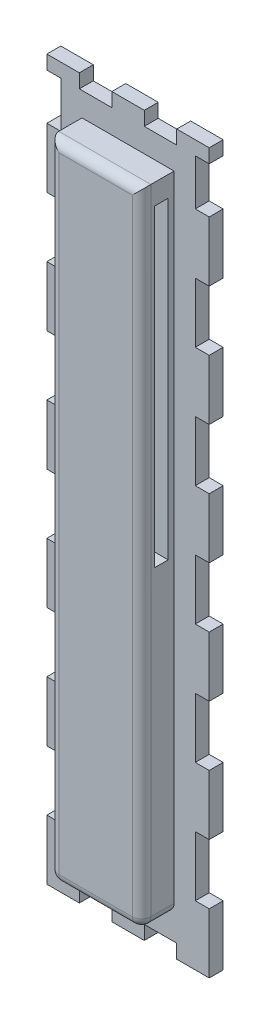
ISO-10303-21;
HEADER;
FILE_DESCRIPTION(('STEP AP214'),'2;1');
FILE_NAME('part.step','',(''),(''),'','','');
FILE_SCHEMA(('AUTOMOTIVE_DESIGN { 1 0 10303 214 1 1 1 1 }'));
ENDSEC;
DATA;
#1=APPLICATION_CONTEXT('core data for automotive mechanical design processes');
#2=APPLICATION_PROTOCOL_DEFINITION('international standard','automotive_design',2000,#1);
#3=PRODUCT_CONTEXT('',#1,'mechanical');
#4=PRODUCT('Part','Part','',(#3));
#5=PRODUCT_RELATED_PRODUCT_CATEGORY('part','',(#4));
#6=PRODUCT_DEFINITION_FORMATION('','',#4);
#7=PRODUCT_DEFINITION_CONTEXT('part definition',#1,'design');
#8=PRODUCT_DEFINITION('design','',#6,#7);
#9=PRODUCT_DEFINITION_SHAPE('','',#8);
#10=(LENGTH_UNIT() NAMED_UNIT(*) SI_UNIT(.MILLI.,.METRE.));
#11=(NAMED_UNIT(*) PLANE_ANGLE_UNIT() SI_UNIT($,.RADIAN.));
#12=(NAMED_UNIT(*) SI_UNIT($,.STERADIAN.) SOLID_ANGLE_UNIT());
#13=UNCERTAINTY_MEASURE_WITH_UNIT(LENGTH_MEASURE(1.E-05),#10,'distance_accuracy_value','');
#14=(GEOMETRIC_REPRESENTATION_CONTEXT(3) GLOBAL_UNCERTAINTY_ASSIGNED_CONTEXT((#13)) GLOBAL_UNIT_ASSIGNED_CONTEXT((#10,
#11,#12)) REPRESENTATION_CONTEXT('',''));
#15=CARTESIAN_POINT('',(0.,0.,0.));
#16=DIRECTION('',(0.,0.,1.));
#17=DIRECTION('',(1.,0.,0.));
#18=AXIS2_PLACEMENT_3D('',#15,#16,#17);
#19=CARTESIAN_POINT('',(0.,0.,3.));
#20=DIRECTION('',(0.,0.,-1.));
#21=DIRECTION('',(-1.,0.,0.));
#22=AXIS2_PLACEMENT_3D('',#19,#20,#21);
#23=PLANE('',#22);
#24=DIRECTION('',(0.,-1.,0.));
#25=VECTOR('',#24,1.);
#26=CARTESIAN_POINT('',(-14.5,0.,3.));
#27=LINE('',#26,#25);
#28=CARTESIAN_POINT('',(-14.5,74.5,3.));
#29=VERTEX_POINT('',#28);
#30=CARTESIAN_POINT('',(-14.5,64.5833333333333,3.));
#31=VERTEX_POINT('',#30);
#32=EDGE_CURVE('E831',#29,#31,#27,.T.);
#33=ORIENTED_EDGE('',*,*,#32,.T.);
#34=DIRECTION('',(-1.,0.,0.));
#35=VECTOR('',#34,1.);
#36=CARTESIAN_POINT('',(0.,64.5833333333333,3.));
#37=LINE('',#36,#35);
#38=CARTESIAN_POINT('',(-17.5,64.5833333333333,3.));
#39=VERTEX_POINT('',#38);
#40=EDGE_CURVE('E834',#31,#39,#37,.T.);
#41=ORIENTED_EDGE('',*,*,#40,.T.);
#42=DIRECTION('',(0.,-1.,0.));
#43=VECTOR('',#42,1.);
#44=CARTESIAN_POINT('',(-17.5,77.5,3.));
#45=LINE('',#44,#43);
#46=CARTESIAN_POINT('',(-17.5,51.6666666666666,2.99999999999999));
#47=VERTEX_POINT('',#46);
#48=EDGE_CURVE('E888',#39,#47,#45,.T.);
#49=ORIENTED_EDGE('',*,*,#48,.T.);
#50=DIRECTION('',(-1.,0.,0.));
#51=VECTOR('',#50,1.);
#52=CARTESIAN_POINT('',(-1.19503172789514E-12,51.666666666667,3.));
#53=LINE('',#52,#51);
#54=CARTESIAN_POINT('',(-14.5,51.6666666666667,2.99999999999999));
#55=VERTEX_POINT('',#54);
#56=EDGE_CURVE('E852',#55,#47,#53,.T.);
#57=ORIENTED_EDGE('',*,*,#56,.F.);
#58=DIRECTION('',(0.,1.,0.));
#59=VECTOR('',#58,1.);
#60=CARTESIAN_POINT('',(-14.5,0.,3.));
#61=LINE('',#60,#59);
#62=CARTESIAN_POINT('',(-14.5,38.75,2.99999999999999));
#63=VERTEX_POINT('',#62);
#64=EDGE_CURVE('E841',#63,#55,#61,.T.);
#65=ORIENTED_EDGE('',*,*,#64,.F.);
#66=DIRECTION('',(1.,0.,0.));
#67=VECTOR('',#66,1.);
#68=CARTESIAN_POINT('',(0.,38.75,3.));
#69=LINE('',#68,#67);
#70=CARTESIAN_POINT('',(-17.5,38.75,2.99999999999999));
#71=VERTEX_POINT('',#70);
#72=EDGE_CURVE('E850',#71,#63,#69,.T.);
#73=ORIENTED_EDGE('',*,*,#72,.F.);
#74=CARTESIAN_POINT('',(-17.5,25.8333333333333,3.));
#75=VERTEX_POINT('',#74);
#76=EDGE_CURVE('E889',#71,#75,#45,.T.);
#77=ORIENTED_EDGE('',*,*,#76,.T.);
#78=DIRECTION('',(-1.,0.,0.));
#79=VECTOR('',#78,1.);
#80=CARTESIAN_POINT('',(-5.97515863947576E-13,25.8333333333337,3.));
#81=LINE('',#80,#79);
#82=CARTESIAN_POINT('',(-14.5,25.8333333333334,3.));
#83=VERTEX_POINT('',#82);
#84=EDGE_CURVE('E826',#83,#75,#81,.T.);
#85=ORIENTED_EDGE('',*,*,#84,.F.);
#86=DIRECTION('',(0.,1.,0.));
#87=VECTOR('',#86,1.);
#88=CARTESIAN_POINT('',(-14.5,0.,3.));
#89=LINE('',#88,#87);
#90=CARTESIAN_POINT('',(-14.5,12.9166666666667,3.));
#91=VERTEX_POINT('',#90);
#92=EDGE_CURVE('E822',#91,#83,#89,.T.);
#93=ORIENTED_EDGE('',*,*,#92,.F.);
#94=DIRECTION('',(1.,0.,0.));
#95=VECTOR('',#94,1.);
#96=CARTESIAN_POINT('',(0.,12.9166666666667,3.));
#97=LINE('',#96,#95);
#98=CARTESIAN_POINT('',(-17.5,12.9166666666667,3.));
#99=VERTEX_POINT('',#98);
#100=EDGE_CURVE('E824',#99,#91,#97,.T.);
#101=ORIENTED_EDGE('',*,*,#100,.F.);
#102=CARTESIAN_POINT('',(-17.5,0.,3.));
#103=VERTEX_POINT('',#102);
#104=EDGE_CURVE('E1622',#99,#103,#45,.T.);
#105=ORIENTED_EDGE('',*,*,#104,.T.);
#106=DIRECTION('',(-1.,0.,0.));
#107=VECTOR('',#106,1.);
#108=CARTESIAN_POINT('',(0.,3.82217405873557E-13,3.));
#109=LINE('',#108,#107);
#110=CARTESIAN_POINT('',(-14.5,0.,3.));
#111=VERTEX_POINT('',#110);
#112=EDGE_CURVE('E791',#111,#103,#109,.T.);
#113=ORIENTED_EDGE('',*,*,#112,.F.);
#114=DIRECTION('',(0.,1.,0.));
#115=VECTOR('',#114,1.);
#116=CARTESIAN_POINT('',(-14.5,0.,3.));
#117=LINE('',#116,#115);
#118=CARTESIAN_POINT('',(-14.5,-12.9166666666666,3.));
#119=VERTEX_POINT('',#118);
#120=EDGE_CURVE('E787',#119,#111,#117,.T.);
#121=ORIENTED_EDGE('',*,*,#120,.F.);
#122=DIRECTION('',(1.,0.,0.));
#123=VECTOR('',#122,1.);
#124=CARTESIAN_POINT('',(0.,-12.9166666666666,3.));
#125=LINE('',#124,#123);
#126=CARTESIAN_POINT('',(-17.5,-12.9166666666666,3.));
#127=VERTEX_POINT('',#126);
#128=EDGE_CURVE('E789',#127,#119,#125,.T.);
#129=ORIENTED_EDGE('',*,*,#128,.F.);
#130=CARTESIAN_POINT('',(-17.5,-25.8333333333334,3.));
#131=VERTEX_POINT('',#130);
#132=EDGE_CURVE('E1621',#127,#131,#45,.T.);
#133=ORIENTED_EDGE('',*,*,#132,.T.);
#134=DIRECTION('',(-1.,0.,0.));
#135=VECTOR('',#134,1.);
#136=CARTESIAN_POINT('',(6.27391657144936E-13,-25.8333333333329,3.));
#137=LINE('',#136,#135);
#138=CARTESIAN_POINT('',(-14.5,-25.8333333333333,3.));
#139=VERTEX_POINT('',#138);
#140=EDGE_CURVE('E820',#139,#131,#137,.T.);
#141=ORIENTED_EDGE('',*,*,#140,.F.);
#142=DIRECTION('',(0.,1.,0.));
#143=VECTOR('',#142,1.);
#144=CARTESIAN_POINT('',(-14.5,0.,3.));
#145=LINE('',#144,#143);
#146=CARTESIAN_POINT('',(-14.5,-38.75,3.));
#147=VERTEX_POINT('',#146);
#148=EDGE_CURVE('E816',#147,#139,#145,.T.);
#149=ORIENTED_EDGE('',*,*,#148,.F.);
#150=DIRECTION('',(1.,0.,0.));
#151=VECTOR('',#150,1.);
#152=CARTESIAN_POINT('',(0.,-38.75,3.));
#153=LINE('',#152,#151);
#154=CARTESIAN_POINT('',(-17.5,-38.75,3.));
#155=VERTEX_POINT('',#154);
#156=EDGE_CURVE('E818',#155,#147,#153,.T.);
#157=ORIENTED_EDGE('',*,*,#156,.F.);
#158=CARTESIAN_POINT('',(-17.5,-51.6666666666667,3.));
#159=VERTEX_POINT('',#158);
#160=EDGE_CURVE('E1619',#155,#159,#45,.T.);
#161=ORIENTED_EDGE('',*,*,#160,.T.);
#162=DIRECTION('',(-1.,0.,0.));
#163=VECTOR('',#162,1.);
#164=CARTESIAN_POINT('',(1.19503172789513E-12,-51.6666666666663,3.));
#165=LINE('',#164,#163);
#166=CARTESIAN_POINT('',(-14.5,-51.6666666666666,3.));
#167=VERTEX_POINT('',#166);
#168=EDGE_CURVE('E797',#167,#159,#165,.T.);
#169=ORIENTED_EDGE('',*,*,#168,.F.);
#170=DIRECTION('',(0.,1.,0.));
#171=VECTOR('',#170,1.);
#172=CARTESIAN_POINT('',(-14.5,0.,3.));
#173=LINE('',#172,#171);
#174=CARTESIAN_POINT('',(-14.5,-64.5833333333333,3.));
#175=VERTEX_POINT('',#174);
#176=EDGE_CURVE('E793',#175,#167,#173,.T.);
#177=ORIENTED_EDGE('',*,*,#176,.F.);
#178=DIRECTION('',(1.,0.,0.));
#179=VECTOR('',#178,1.);
#180=CARTESIAN_POINT('',(0.,-64.5833333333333,3.));
#181=LINE('',#180,#179);
#182=CARTESIAN_POINT('',(-17.5,-64.5833333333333,3.));
#183=VERTEX_POINT('',#182);
#184=EDGE_CURVE('E795',#183,#175,#181,.T.);
#185=ORIENTED_EDGE('',*,*,#184,.F.);
#186=CARTESIAN_POINT('',(-17.5,-77.5,3.));
#187=VERTEX_POINT('',#186);
#188=EDGE_CURVE('E883',#183,#187,#45,.T.);
#189=ORIENTED_EDGE('',*,*,#188,.T.);
#190=DIRECTION('',(1.,0.,0.));
#191=VECTOR('',#190,1.);
#192=CARTESIAN_POINT('',(-17.5,-77.5,3.));
#193=LINE('',#192,#191);
#194=CARTESIAN_POINT('',(-10.5,-77.5,3.));
#195=VERTEX_POINT('',#194);
#196=EDGE_CURVE('E887',#187,#195,#193,.T.);
#197=ORIENTED_EDGE('',*,*,#196,.T.);
#198=DIRECTION('',(0.,1.,0.));
#199=VECTOR('',#198,1.);
#200=CARTESIAN_POINT('',(-10.5,-74.5,3.));
#201=LINE('',#200,#199);
#202=CARTESIAN_POINT('',(-10.5,-74.5,3.));
#203=VERTEX_POINT('',#202);
#204=EDGE_CURVE('E891',#195,#203,#201,.T.);
#205=ORIENTED_EDGE('',*,*,#204,.T.);
#206=DIRECTION('',(1.,0.,0.));
#207=VECTOR('',#206,1.);
#208=CARTESIAN_POINT('',(-10.5,-74.5,3.));
#209=LINE('',#208,#207);
#210=CARTESIAN_POINT('',(-3.50000000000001,-74.5,3.));
#211=VERTEX_POINT('',#210);
#212=EDGE_CURVE('E893',#203,#211,#209,.T.);
#213=ORIENTED_EDGE('',*,*,#212,.T.);
#214=DIRECTION('',(0.,-1.,0.));
#215=VECTOR('',#214,1.);
#216=CARTESIAN_POINT('',(-3.50000000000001,-74.5,3.));
#217=LINE('',#216,#215);
#218=CARTESIAN_POINT('',(-3.50000000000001,-77.5,3.));
#219=VERTEX_POINT('',#218);
#220=EDGE_CURVE('E895',#211,#219,#217,.T.);
#221=ORIENTED_EDGE('',*,*,#220,.T.);
#222=DIRECTION('',(1.,0.,0.));
#223=VECTOR('',#222,1.);
#224=CARTESIAN_POINT('',(-3.50000000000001,-77.5,3.));
#225=LINE('',#224,#223);
#226=CARTESIAN_POINT('',(3.49999999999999,-77.5,3.));
#227=VERTEX_POINT('',#226);
#228=EDGE_CURVE('E897',#219,#227,#225,.T.);
#229=ORIENTED_EDGE('',*,*,#228,.T.);
#230=DIRECTION('',(0.,1.,0.));
#231=VECTOR('',#230,1.);
#232=CARTESIAN_POINT('',(3.49999999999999,-74.5,3.));
#233=LINE('',#232,#231);
#234=CARTESIAN_POINT('',(3.49999999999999,-74.5,3.));
#235=VERTEX_POINT('',#234);
#236=EDGE_CURVE('E899',#227,#235,#233,.T.);
#237=ORIENTED_EDGE('',*,*,#236,.T.);
#238=DIRECTION('',(1.,0.,0.));
#239=VECTOR('',#238,1.);
#240=CARTESIAN_POINT('',(3.49999999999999,-74.5,3.));
#241=LINE('',#240,#239);
#242=CARTESIAN_POINT('',(10.5,-74.5,3.));
#243=VERTEX_POINT('',#242);
#244=EDGE_CURVE('E901',#235,#243,#241,.T.);
#245=ORIENTED_EDGE('',*,*,#244,.T.);
#246=DIRECTION('',(0.,-1.,0.));
#247=VECTOR('',#246,1.);
#248=CARTESIAN_POINT('',(10.5,-74.5,3.));
#249=LINE('',#248,#247);
#250=CARTESIAN_POINT('',(10.5,-77.5,3.));
#251=VERTEX_POINT('',#250);
#252=EDGE_CURVE('E903',#243,#251,#249,.T.);
#253=ORIENTED_EDGE('',*,*,#252,.T.);
#254=DIRECTION('',(1.,0.,0.));
#255=VECTOR('',#254,1.);
#256=CARTESIAN_POINT('',(10.5,-77.5,3.));
#257=LINE('',#256,#255);
#258=CARTESIAN_POINT('',(17.5,-77.5,3.));
#259=VERTEX_POINT('',#258);
#260=EDGE_CURVE('E856',#251,#259,#257,.T.);
#261=ORIENTED_EDGE('',*,*,#260,.T.);
#262=DIRECTION('',(0.,1.,0.));
#263=VECTOR('',#262,1.);
#264=CARTESIAN_POINT('',(17.5,77.5,3.));
#265=LINE('',#264,#263);
#266=CARTESIAN_POINT('',(17.5,-64.5833333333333,3.));
#267=VERTEX_POINT('',#266);
#268=EDGE_CURVE('E861',#259,#267,#265,.T.);
#269=ORIENTED_EDGE('',*,*,#268,.T.);
#270=DIRECTION('',(1.,0.,0.));
#271=VECTOR('',#270,1.);
#272=CARTESIAN_POINT('',(0.,-64.5833333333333,3.));
#273=LINE('',#272,#271);
#274=CARTESIAN_POINT('',(14.5,-64.5833333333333,3.));
#275=VERTEX_POINT('',#274);
#276=EDGE_CURVE('E780',#275,#267,#273,.T.);
#277=ORIENTED_EDGE('',*,*,#276,.F.);
#278=DIRECTION('',(0.,-1.,0.));
#279=VECTOR('',#278,1.);
#280=CARTESIAN_POINT('',(14.5,0.,3.));
#281=LINE('',#280,#279);
#282=CARTESIAN_POINT('',(14.5,-51.6666666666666,3.));
#283=VERTEX_POINT('',#282);
#284=EDGE_CURVE('E814',#283,#275,#281,.T.);
#285=ORIENTED_EDGE('',*,*,#284,.F.);
#286=DIRECTION('',(-1.,0.,0.));
#287=VECTOR('',#286,1.);
#288=CARTESIAN_POINT('',(-1.19503172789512E-12,-51.6666666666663,3.));
#289=LINE('',#288,#287);
#290=CARTESIAN_POINT('',(17.5,-51.6666666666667,3.));
#291=VERTEX_POINT('',#290);
#292=EDGE_CURVE('E785',#291,#283,#289,.T.);
#293=ORIENTED_EDGE('',*,*,#292,.F.);
#294=CARTESIAN_POINT('',(17.5,-38.7499999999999,3.));
#295=VERTEX_POINT('',#294);
#296=EDGE_CURVE('E865',#291,#295,#265,.T.);
#297=ORIENTED_EDGE('',*,*,#296,.T.);
#298=DIRECTION('',(-1.,0.,0.));
#299=VECTOR('',#298,1.);
#300=CARTESIAN_POINT('',(0.,-38.7499999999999,3.));
#301=LINE('',#300,#299);
#302=CARTESIAN_POINT('',(14.5,-38.7499999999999,3.));
#303=VERTEX_POINT('',#302);
#304=EDGE_CURVE('E734',#295,#303,#301,.T.);
#305=ORIENTED_EDGE('',*,*,#304,.T.);
#306=DIRECTION('',(0.,1.,0.));
#307=VECTOR('',#306,1.);
#308=CARTESIAN_POINT('',(14.5,0.,3.));
#309=LINE('',#308,#307);
#310=CARTESIAN_POINT('',(14.5,-25.8333333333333,3.));
#311=VERTEX_POINT('',#310);
#312=EDGE_CURVE('E799',#303,#311,#309,.T.);
#313=ORIENTED_EDGE('',*,*,#312,.T.);
#314=DIRECTION('',(1.,0.,0.));
#315=VECTOR('',#314,1.);
#316=CARTESIAN_POINT('',(-6.27391657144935E-13,-25.8333333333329,3.));
#317=LINE('',#316,#315);
#318=CARTESIAN_POINT('',(17.5,-25.8333333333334,3.));
#319=VERTEX_POINT('',#318);
#320=EDGE_CURVE('E729',#311,#319,#317,.T.);
#321=ORIENTED_EDGE('',*,*,#320,.T.);
#322=CARTESIAN_POINT('',(17.5,-12.9166666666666,3.));
#323=VERTEX_POINT('',#322);
#324=EDGE_CURVE('E2392',#319,#323,#265,.T.);
#325=ORIENTED_EDGE('',*,*,#324,.T.);
#326=DIRECTION('',(-1.,0.,0.));
#327=VECTOR('',#326,1.);
#328=CARTESIAN_POINT('',(0.,-12.9166666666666,3.));
#329=LINE('',#328,#327);
#330=CARTESIAN_POINT('',(14.5,-12.9166666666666,3.));
#331=VERTEX_POINT('',#330);
#332=EDGE_CURVE('E774',#323,#331,#329,.T.);
#333=ORIENTED_EDGE('',*,*,#332,.T.);
#334=DIRECTION('',(0.,1.,0.));
#335=VECTOR('',#334,1.);
#336=CARTESIAN_POINT('',(14.5,0.,3.));
#337=LINE('',#336,#335);
#338=CARTESIAN_POINT('',(14.5,0.,3.));
#339=VERTEX_POINT('',#338);
#340=EDGE_CURVE('E811',#331,#339,#337,.T.);
#341=ORIENTED_EDGE('',*,*,#340,.T.);
#342=DIRECTION('',(1.,0.,0.));
#343=VECTOR('',#342,1.);
#344=CARTESIAN_POINT('',(0.,3.82217405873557E-13,3.));
#345=LINE('',#344,#343);
#346=CARTESIAN_POINT('',(17.5,0.,3.));
#347=VERTEX_POINT('',#346);
#348=EDGE_CURVE('E769',#339,#347,#345,.T.);
#349=ORIENTED_EDGE('',*,*,#348,.T.);
#350=CARTESIAN_POINT('',(17.5,12.9166666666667,3.));
#351=VERTEX_POINT('',#350);
#352=EDGE_CURVE('E2389',#347,#351,#265,.T.);
#353=ORIENTED_EDGE('',*,*,#352,.T.);
#354=DIRECTION('',(-1.,0.,0.));
#355=VECTOR('',#354,1.);
#356=CARTESIAN_POINT('',(0.,12.9166666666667,3.));
#357=LINE('',#356,#355);
#358=CARTESIAN_POINT('',(14.5,12.9166666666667,3.));
#359=VERTEX_POINT('',#358);
#360=EDGE_CURVE('E744',#351,#359,#357,.T.);
#361=ORIENTED_EDGE('',*,*,#360,.T.);
#362=DIRECTION('',(0.,1.,0.));
#363=VECTOR('',#362,1.);
#364=CARTESIAN_POINT('',(14.5,0.,3.));
#365=LINE('',#364,#363);
#366=CARTESIAN_POINT('',(14.5,25.8333333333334,3.));
#367=VERTEX_POINT('',#366);
#368=EDGE_CURVE('E802',#359,#367,#365,.T.);
#369=ORIENTED_EDGE('',*,*,#368,.T.);
#370=DIRECTION('',(1.,0.,0.));
#371=VECTOR('',#370,1.);
#372=CARTESIAN_POINT('',(5.97515863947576E-13,25.8333333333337,3.));
#373=LINE('',#372,#371);
#374=CARTESIAN_POINT('',(17.5,25.8333333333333,3.));
#375=VERTEX_POINT('',#374);
#376=EDGE_CURVE('E739',#367,#375,#373,.T.);
#377=ORIENTED_EDGE('',*,*,#376,.T.);
#378=CARTESIAN_POINT('',(17.5,38.7500000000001,3.));
#379=VERTEX_POINT('',#378);
#380=EDGE_CURVE('E2393',#375,#379,#265,.T.);
#381=ORIENTED_EDGE('',*,*,#380,.T.);
#382=DIRECTION('',(-1.,0.,0.));
#383=VECTOR('',#382,1.);
#384=CARTESIAN_POINT('',(0.,38.7500000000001,3.));
#385=LINE('',#384,#383);
#386=CARTESIAN_POINT('',(14.5,38.7500000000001,3.));
#387=VERTEX_POINT('',#386);
#388=EDGE_CURVE('E764',#379,#387,#385,.T.);
#389=ORIENTED_EDGE('',*,*,#388,.T.);
#390=DIRECTION('',(0.,1.,0.));
#391=VECTOR('',#390,1.);
#392=CARTESIAN_POINT('',(14.5,0.,3.));
#393=LINE('',#392,#391);
#394=CARTESIAN_POINT('',(14.5,51.6666666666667,3.));
#395=VERTEX_POINT('',#394);
#396=EDGE_CURVE('E808',#387,#395,#393,.T.);
#397=ORIENTED_EDGE('',*,*,#396,.T.);
#398=DIRECTION('',(1.,0.,0.));
#399=VECTOR('',#398,1.);
#400=CARTESIAN_POINT('',(1.19503172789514E-12,51.6666666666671,3.));
#401=LINE('',#400,#399);
#402=CARTESIAN_POINT('',(17.5,51.6666666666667,3.));
#403=VERTEX_POINT('',#402);
#404=EDGE_CURVE('E759',#395,#403,#401,.T.);
#405=ORIENTED_EDGE('',*,*,#404,.T.);
#406=CARTESIAN_POINT('',(17.5,64.5833333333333,3.));
#407=VERTEX_POINT('',#406);
#408=EDGE_CURVE('E2396',#403,#407,#265,.T.);
#409=ORIENTED_EDGE('',*,*,#408,.T.);
#410=DIRECTION('',(-1.,0.,0.));
#411=VECTOR('',#410,1.);
#412=CARTESIAN_POINT('',(0.,64.5833333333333,3.));
#413=LINE('',#412,#411);
#414=CARTESIAN_POINT('',(14.5,64.5833333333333,3.));
#415=VERTEX_POINT('',#414);
#416=EDGE_CURVE('E749',#407,#415,#413,.T.);
#417=ORIENTED_EDGE('',*,*,#416,.T.);
#418=DIRECTION('',(0.,1.,0.));
#419=VECTOR('',#418,1.);
#420=CARTESIAN_POINT('',(14.5,0.,3.));
#421=LINE('',#420,#419);
#422=CARTESIAN_POINT('',(14.5,74.5,3.));
#423=VERTEX_POINT('',#422);
#424=EDGE_CURVE('E805',#415,#423,#421,.T.);
#425=ORIENTED_EDGE('',*,*,#424,.T.);
#426=DIRECTION('',(-1.,0.,0.));
#427=VECTOR('',#426,1.);
#428=CARTESIAN_POINT('',(0.,74.5,3.));
#429=LINE('',#428,#427);
#430=CARTESIAN_POINT('',(17.5,74.5,3.));
#431=VERTEX_POINT('',#430);
#432=EDGE_CURVE('E755',#431,#423,#429,.T.);
#433=ORIENTED_EDGE('',*,*,#432,.F.);
#434=CARTESIAN_POINT('',(17.5,77.5,3.));
#435=VERTEX_POINT('',#434);
#436=EDGE_CURVE('E859',#431,#435,#265,.T.);
#437=ORIENTED_EDGE('',*,*,#436,.T.);
#438=DIRECTION('',(-1.,0.,0.));
#439=VECTOR('',#438,1.);
#440=CARTESIAN_POINT('',(10.5,77.5,3.));
#441=LINE('',#440,#439);
#442=CARTESIAN_POINT('',(10.5,77.5,3.));
#443=VERTEX_POINT('',#442);
#444=EDGE_CURVE('E864',#435,#443,#441,.T.);
#445=ORIENTED_EDGE('',*,*,#444,.T.);
#446=DIRECTION('',(0.,-1.,0.));
#447=VECTOR('',#446,1.);
#448=CARTESIAN_POINT('',(10.5,74.5,3.));
#449=LINE('',#448,#447);
#450=CARTESIAN_POINT('',(10.5,74.5,3.));
#451=VERTEX_POINT('',#450);
#452=EDGE_CURVE('E867',#443,#451,#449,.T.);
#453=ORIENTED_EDGE('',*,*,#452,.T.);
#454=DIRECTION('',(-1.,0.,0.));
#455=VECTOR('',#454,1.);
#456=CARTESIAN_POINT('',(3.49999999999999,74.5,3.));
#457=LINE('',#456,#455);
#458=CARTESIAN_POINT('',(3.49999999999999,74.5,3.));
#459=VERTEX_POINT('',#458);
#460=EDGE_CURVE('E869',#451,#459,#457,.T.);
#461=ORIENTED_EDGE('',*,*,#460,.T.);
#462=DIRECTION('',(0.,1.,0.));
#463=VECTOR('',#462,1.);
#464=CARTESIAN_POINT('',(3.49999999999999,74.5,3.));
#465=LINE('',#464,#463);
#466=CARTESIAN_POINT('',(3.49999999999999,77.5,3.));
#467=VERTEX_POINT('',#466);
#468=EDGE_CURVE('E871',#459,#467,#465,.T.);
#469=ORIENTED_EDGE('',*,*,#468,.T.);
#470=DIRECTION('',(-1.,0.,0.));
#471=VECTOR('',#470,1.);
#472=CARTESIAN_POINT('',(-3.50000000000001,77.5,3.));
#473=LINE('',#472,#471);
#474=CARTESIAN_POINT('',(-3.50000000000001,77.5,3.));
#475=VERTEX_POINT('',#474);
#476=EDGE_CURVE('E873',#467,#475,#473,.T.);
#477=ORIENTED_EDGE('',*,*,#476,.T.);
#478=DIRECTION('',(0.,-1.,0.));
#479=VECTOR('',#478,1.);
#480=CARTESIAN_POINT('',(-3.50000000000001,74.5,3.));
#481=LINE('',#480,#479);
#482=CARTESIAN_POINT('',(-3.50000000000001,74.5,3.));
#483=VERTEX_POINT('',#482);
#484=EDGE_CURVE('E875',#475,#483,#481,.T.);
#485=ORIENTED_EDGE('',*,*,#484,.T.);
#486=DIRECTION('',(-1.,0.,0.));
#487=VECTOR('',#486,1.);
#488=CARTESIAN_POINT('',(-10.5,74.5,3.));
#489=LINE('',#488,#487);
#490=CARTESIAN_POINT('',(-10.5,74.5,3.));
#491=VERTEX_POINT('',#490);
#492=EDGE_CURVE('E877',#483,#491,#489,.T.);
#493=ORIENTED_EDGE('',*,*,#492,.T.);
#494=DIRECTION('',(0.,1.,0.));
#495=VECTOR('',#494,1.);
#496=CARTESIAN_POINT('',(-10.5,74.5,3.));
#497=LINE('',#496,#495);
#498=CARTESIAN_POINT('',(-10.5,77.5,3.));
#499=VERTEX_POINT('',#498);
#500=EDGE_CURVE('E879',#491,#499,#497,.T.);
#501=ORIENTED_EDGE('',*,*,#500,.T.);
#502=DIRECTION('',(-1.,0.,0.));
#503=VECTOR('',#502,1.);
#504=CARTESIAN_POINT('',(-17.5,77.5,3.));
#505=LINE('',#504,#503);
#506=CARTESIAN_POINT('',(-17.5,77.5,3.));
#507=VERTEX_POINT('',#506);
#508=EDGE_CURVE('E881',#499,#507,#505,.T.);
#509=ORIENTED_EDGE('',*,*,#508,.T.);
#510=CARTESIAN_POINT('',(-17.5,74.5,3.));
#511=VERTEX_POINT('',#510);
#512=EDGE_CURVE('E884',#507,#511,#45,.T.);
#513=ORIENTED_EDGE('',*,*,#512,.T.);
#514=DIRECTION('',(1.,0.,0.));
#515=VECTOR('',#514,1.);
#516=CARTESIAN_POINT('',(0.,74.5,3.));
#517=LINE('',#516,#515);
#518=EDGE_CURVE('E828',#511,#29,#517,.T.);
#519=ORIENTED_EDGE('',*,*,#518,.T.);
#520=EDGE_LOOP('',(#33,#41,#49,#57,#65,#73,#77,#85,#93,#101,#105,#113,#121,#129,#133,#141,#149,
#157,#161,#169,#177,#185,#189,#197,#205,#213,#221,#229,#237,#245,#253,#261,#269,#277,#285,#293,
#297,#305,#313,#321,#325,#333,#341,#349,#353,#361,#369,#377,#381,#389,#397,#405,#409,#417,#425,
#433,#437,#445,#453,#461,#469,#477,#485,#493,#501,#509,#513,#519));
#521=FACE_BOUND('',#520,.T.);
#522=DIRECTION('',(0.,1.,0.));
#523=VECTOR('',#522,1.);
#524=CARTESIAN_POINT('',(9.92436714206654,69.3671911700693,3.));
#525=LINE('',#524,#523);
#526=CARTESIAN_POINT('',(9.92436714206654,-67.3671911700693,3.));
#527=VERTEX_POINT('',#526);
#528=CARTESIAN_POINT('',(9.92436714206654,69.3671911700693,3.));
#529=VERTEX_POINT('',#528);
#530=EDGE_CURVE('E616',#527,#529,#525,.T.);
#531=ORIENTED_EDGE('',*,*,#530,.F.);
#532=CARTESIAN_POINT('',(7.92436714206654,-67.3671911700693,3.));
#533=DIRECTION('',(0.,0.,-1.));
#534=DIRECTION('',(-1.,0.,0.));
#535=AXIS2_PLACEMENT_3D('',#532,#533,#534);
#536=CIRCLE('',#535,2.);
#537=CARTESIAN_POINT('',(7.92436714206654,-69.3671911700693,3.));
#538=VERTEX_POINT('',#537);
#539=EDGE_CURVE('E1143',#527,#538,#536,.T.);
#540=ORIENTED_EDGE('',*,*,#539,.T.);
#541=DIRECTION('',(1.,0.,0.));
#542=VECTOR('',#541,1.);
#543=CARTESIAN_POINT('',(-9.92436714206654,-69.3671911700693,3.));
#544=LINE('',#543,#542);
#545=CARTESIAN_POINT('',(-7.92436714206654,-69.3671911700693,3.));
#546=VERTEX_POINT('',#545);
#547=EDGE_CURVE('E628',#546,#538,#544,.T.);
#548=ORIENTED_EDGE('',*,*,#547,.F.);
#549=CARTESIAN_POINT('',(-7.92436714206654,-67.3671911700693,3.));
#550=DIRECTION('',(0.,0.,-1.));
#551=DIRECTION('',(-1.,0.,0.));
#552=AXIS2_PLACEMENT_3D('',#549,#550,#551);
#553=CIRCLE('',#552,2.);
#554=CARTESIAN_POINT('',(-9.92436714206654,-67.3671911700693,3.));
#555=VERTEX_POINT('',#554);
#556=EDGE_CURVE('E58',#546,#555,#553,.T.);
#557=ORIENTED_EDGE('',*,*,#556,.T.);
#558=DIRECTION('',(0.,-1.,0.));
#559=VECTOR('',#558,1.);
#560=CARTESIAN_POINT('',(-9.92436714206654,69.3671911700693,3.));
#561=LINE('',#560,#559);
#562=CARTESIAN_POINT('',(-9.92436714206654,69.3671911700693,3.));
#563=VERTEX_POINT('',#562);
#564=EDGE_CURVE('E626',#563,#555,#561,.T.);
#565=ORIENTED_EDGE('',*,*,#564,.F.);
#566=DIRECTION('',(-1.,0.,0.));
#567=VECTOR('',#566,1.);
#568=CARTESIAN_POINT('',(-9.92436714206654,69.3671911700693,3.));
#569=LINE('',#568,#567);
#570=EDGE_CURVE('E623',#529,#563,#569,.T.);
#571=ORIENTED_EDGE('',*,*,#570,.F.);
#572=EDGE_LOOP('',(#531,#540,#548,#557,#565,#571));
#573=FACE_BOUND('',#572,.T.);
#574=ADVANCED_FACE('F35',(#521,#573),#23,.F.);
#575=CARTESIAN_POINT('',(-17.5,77.5,3.));
#576=DIRECTION('',(1.,0.,0.));
#577=DIRECTION('',(0.,1.,0.));
#578=AXIS2_PLACEMENT_3D('',#575,#576,#577);
#579=PLANE('',#578);
#580=ORIENTED_EDGE('',*,*,#48,.F.);
#581=DIRECTION('',(0.,0.,-1.));
#582=VECTOR('',#581,1.);
#583=CARTESIAN_POINT('',(-17.5,64.5833333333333,18.));
#584=LINE('',#583,#582);
#585=CARTESIAN_POINT('',(-17.5,64.5833333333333,0.));
#586=VERTEX_POINT('',#585);
#587=EDGE_CURVE('E682',#39,#586,#584,.T.);
#588=ORIENTED_EDGE('',*,*,#587,.T.);
#589=DIRECTION('',(0.,-1.,0.));
#590=VECTOR('',#589,1.);
#591=CARTESIAN_POINT('',(-17.5,77.5,0.));
#592=LINE('',#591,#590);
#593=CARTESIAN_POINT('',(-17.5,51.6666666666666,0.));
#594=VERTEX_POINT('',#593);
#595=EDGE_CURVE('E936',#586,#594,#592,.T.);
#596=ORIENTED_EDGE('',*,*,#595,.T.);
#597=DIRECTION('',(0.,0.,1.));
#598=VECTOR('',#597,1.);
#599=CARTESIAN_POINT('',(-17.5,51.6666666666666,-41.));
#600=LINE('',#599,#598);
#601=EDGE_CURVE('E837',#594,#47,#600,.T.);
#602=ORIENTED_EDGE('',*,*,#601,.T.);
#603=EDGE_LOOP('',(#580,#588,#596,#602));
#604=FACE_BOUND('',#603,.T.);
#605=ADVANCED_FACE('F1254',(#604),#579,.F.);
#606=DIRECTION('',(0.,0.,-1.));
#607=VECTOR('',#606,1.);
#608=CARTESIAN_POINT('',(-17.5,25.8333333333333,18.));
#609=LINE('',#608,#607);
#610=CARTESIAN_POINT('',(-17.5,25.8333333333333,0.));
#611=VERTEX_POINT('',#610);
#612=EDGE_CURVE('E671',#75,#611,#609,.T.);
#613=ORIENTED_EDGE('',*,*,#612,.F.);
#614=ORIENTED_EDGE('',*,*,#76,.F.);
#615=DIRECTION('',(0.,0.,1.));
#616=VECTOR('',#615,1.);
#617=CARTESIAN_POINT('',(-17.5,38.75,-41.));
#618=LINE('',#617,#616);
#619=CARTESIAN_POINT('',(-17.5,38.75,0.));
#620=VERTEX_POINT('',#619);
#621=EDGE_CURVE('E845',#620,#71,#618,.T.);
#622=ORIENTED_EDGE('',*,*,#621,.F.);
#623=EDGE_CURVE('E937',#620,#611,#592,.T.);
#624=ORIENTED_EDGE('',*,*,#623,.T.);
#625=EDGE_LOOP('',(#613,#614,#622,#624));
#626=FACE_BOUND('',#625,.T.);
#627=ADVANCED_FACE('F1262',(#626),#579,.F.);
#628=DIRECTION('',(0.,0.,-1.));
#629=VECTOR('',#628,1.);
#630=CARTESIAN_POINT('',(-17.5,12.9166666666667,18.));
#631=LINE('',#630,#629);
#632=CARTESIAN_POINT('',(-17.5,12.9166666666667,0.));
#633=VERTEX_POINT('',#632);
#634=EDGE_CURVE('E673',#99,#633,#631,.T.);
#635=ORIENTED_EDGE('',*,*,#634,.T.);
#636=CARTESIAN_POINT('',(-17.5,0.,0.));
#637=VERTEX_POINT('',#636);
#638=EDGE_CURVE('E1585',#633,#637,#592,.T.);
#639=ORIENTED_EDGE('',*,*,#638,.T.);
#640=DIRECTION('',(0.,0.,-1.));
#641=VECTOR('',#640,1.);
#642=CARTESIAN_POINT('',(-17.5,0.,18.));
#643=LINE('',#642,#641);
#644=EDGE_CURVE('E690',#103,#637,#643,.T.);
#645=ORIENTED_EDGE('',*,*,#644,.F.);
#646=ORIENTED_EDGE('',*,*,#104,.F.);
#647=EDGE_LOOP('',(#635,#639,#645,#646));
#648=FACE_BOUND('',#647,.T.);
#649=ADVANCED_FACE('F1650',(#648),#579,.F.);
#650=DIRECTION('',(0.,0.,-1.));
#651=VECTOR('',#650,1.);
#652=CARTESIAN_POINT('',(-17.5,-25.8333333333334,18.));
#653=LINE('',#652,#651);
#654=CARTESIAN_POINT('',(-17.5,-25.8333333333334,0.));
#655=VERTEX_POINT('',#654);
#656=EDGE_CURVE('E661',#131,#655,#653,.T.);
#657=ORIENTED_EDGE('',*,*,#656,.F.);
#658=ORIENTED_EDGE('',*,*,#132,.F.);
#659=DIRECTION('',(0.,0.,-1.));
#660=VECTOR('',#659,1.);
#661=CARTESIAN_POINT('',(-17.5,-12.9166666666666,18.));
#662=LINE('',#661,#660);
#663=CARTESIAN_POINT('',(-17.5,-12.9166666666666,0.));
#664=VERTEX_POINT('',#663);
#665=EDGE_CURVE('E692',#127,#664,#662,.T.);
#666=ORIENTED_EDGE('',*,*,#665,.T.);
#667=EDGE_CURVE('E1588',#664,#655,#592,.T.);
#668=ORIENTED_EDGE('',*,*,#667,.T.);
#669=EDGE_LOOP('',(#657,#658,#666,#668));
#670=FACE_BOUND('',#669,.T.);
#671=ADVANCED_FACE('F1634',(#670),#579,.F.);
#672=DIRECTION('',(0.,0.,-1.));
#673=VECTOR('',#672,1.);
#674=CARTESIAN_POINT('',(-17.5,-38.75,18.));
#675=LINE('',#674,#673);
#676=CARTESIAN_POINT('',(-17.5,-38.75,0.));
#677=VERTEX_POINT('',#676);
#678=EDGE_CURVE('E663',#155,#677,#675,.T.);
#679=ORIENTED_EDGE('',*,*,#678,.T.);
#680=CARTESIAN_POINT('',(-17.5,-51.6666666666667,0.));
#681=VERTEX_POINT('',#680);
#682=EDGE_CURVE('E1593',#677,#681,#592,.T.);
#683=ORIENTED_EDGE('',*,*,#682,.T.);
#684=DIRECTION('',(0.,0.,-1.));
#685=VECTOR('',#684,1.);
#686=CARTESIAN_POINT('',(-17.5,-51.6666666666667,18.));
#687=LINE('',#686,#685);
#688=EDGE_CURVE('E702',#159,#681,#687,.T.);
#689=ORIENTED_EDGE('',*,*,#688,.F.);
#690=ORIENTED_EDGE('',*,*,#160,.F.);
#691=EDGE_LOOP('',(#679,#683,#689,#690));
#692=FACE_BOUND('',#691,.T.);
#693=ADVANCED_FACE('F1641',(#692),#579,.F.);
#694=DIRECTION('',(0.,0.,-1.));
#695=VECTOR('',#694,1.);
#696=CARTESIAN_POINT('',(-17.5,-64.5833333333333,18.));
#697=LINE('',#696,#695);
#698=CARTESIAN_POINT('',(-17.5,-64.5833333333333,0.));
#699=VERTEX_POINT('',#698);
#700=EDGE_CURVE('E704',#183,#699,#697,.T.);
#701=ORIENTED_EDGE('',*,*,#700,.T.);
#702=CARTESIAN_POINT('',(-17.5,-77.5,0.));
#703=VERTEX_POINT('',#702);
#704=EDGE_CURVE('E931',#699,#703,#592,.T.);
#705=ORIENTED_EDGE('',*,*,#704,.T.);
#706=DIRECTION('',(0.,0.,-1.));
#707=VECTOR('',#706,1.);
#708=CARTESIAN_POINT('',(-17.5,-77.5,3.));
#709=LINE('',#708,#707);
#710=EDGE_CURVE('E975',#187,#703,#709,.T.);
#711=ORIENTED_EDGE('',*,*,#710,.F.);
#712=ORIENTED_EDGE('',*,*,#188,.F.);
#713=EDGE_LOOP('',(#701,#705,#711,#712));
#714=FACE_BOUND('',#713,.T.);
#715=ADVANCED_FACE('F1274',(#714),#579,.F.);
#716=CARTESIAN_POINT('',(0.,0.,0.));
#717=DIRECTION('',(0.,0.,-1.));
#718=DIRECTION('',(-1.,0.,0.));
#719=AXIS2_PLACEMENT_3D('',#716,#717,#718);
#720=PLANE('',#719);
#721=DIRECTION('',(0.,-1.,0.));
#722=VECTOR('',#721,1.);
#723=CARTESIAN_POINT('',(6.69394360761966,0.,0.));
#724=LINE('',#723,#722);
#725=CARTESIAN_POINT('',(6.69394360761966,66.3160525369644,0.));
#726=VERTEX_POINT('',#725);
#727=CARTESIAN_POINT('',(6.69394360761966,-66.3160525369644,0.));
#728=VERTEX_POINT('',#727);
#729=EDGE_CURVE('E1113',#726,#728,#724,.T.);
#730=ORIENTED_EDGE('',*,*,#729,.F.);
#731=DIRECTION('',(1.,0.,0.));
#732=VECTOR('',#731,1.);
#733=CARTESIAN_POINT('',(0.,66.3160525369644,0.));
#734=LINE('',#733,#732);
#735=CARTESIAN_POINT('',(-6.69394360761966,66.3160525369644,0.));
#736=VERTEX_POINT('',#735);
#737=EDGE_CURVE('E1108',#736,#726,#734,.T.);
#738=ORIENTED_EDGE('',*,*,#737,.F.);
#739=DIRECTION('',(0.,1.,0.));
#740=VECTOR('',#739,1.);
#741=CARTESIAN_POINT('',(-6.69394360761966,0.,0.));
#742=LINE('',#741,#740);
#743=CARTESIAN_POINT('',(-6.69394360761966,-66.3160525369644,0.));
#744=VERTEX_POINT('',#743);
#745=EDGE_CURVE('E566',#744,#736,#742,.T.);
#746=ORIENTED_EDGE('',*,*,#745,.F.);
#747=DIRECTION('',(-1.,0.,0.));
#748=VECTOR('',#747,1.);
#749=CARTESIAN_POINT('',(0.,-66.3160525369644,0.));
#750=LINE('',#749,#748);
#751=EDGE_CURVE('E1111',#728,#744,#750,.T.);
#752=ORIENTED_EDGE('',*,*,#751,.F.);
#753=EDGE_LOOP('',(#730,#738,#746,#752));
#754=FACE_BOUND('',#753,.T.);
#755=DIRECTION('',(-1.,0.,0.));
#756=VECTOR('',#755,1.);
#757=CARTESIAN_POINT('',(0.,64.5833333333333,0.));
#758=LINE('',#757,#756);
#759=CARTESIAN_POINT('',(-14.5,64.5833333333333,0.));
#760=VERTEX_POINT('',#759);
#761=EDGE_CURVE('E1106',#760,#586,#758,.T.);
#762=ORIENTED_EDGE('',*,*,#761,.F.);
#763=DIRECTION('',(0.,-1.,0.));
#764=VECTOR('',#763,1.);
#765=CARTESIAN_POINT('',(-14.5,0.,0.));
#766=LINE('',#765,#764);
#767=CARTESIAN_POINT('',(-14.5,74.5,0.));
#768=VERTEX_POINT('',#767);
#769=EDGE_CURVE('E1104',#768,#760,#766,.T.);
#770=ORIENTED_EDGE('',*,*,#769,.F.);
#771=DIRECTION('',(1.,0.,0.));
#772=VECTOR('',#771,1.);
#773=CARTESIAN_POINT('',(0.,74.5,0.));
#774=LINE('',#773,#772);
#775=CARTESIAN_POINT('',(-17.5,74.5,0.));
#776=VERTEX_POINT('',#775);
#777=EDGE_CURVE('E1102',#776,#768,#774,.T.);
#778=ORIENTED_EDGE('',*,*,#777,.F.);
#779=CARTESIAN_POINT('',(-17.5,77.5,0.));
#780=VERTEX_POINT('',#779);
#781=EDGE_CURVE('E932',#780,#776,#592,.T.);
#782=ORIENTED_EDGE('',*,*,#781,.F.);
#783=DIRECTION('',(-1.,0.,0.));
#784=VECTOR('',#783,1.);
#785=CARTESIAN_POINT('',(-17.5,77.5,0.));
#786=LINE('',#785,#784);
#787=CARTESIAN_POINT('',(-10.5,77.5,0.));
#788=VERTEX_POINT('',#787);
#789=EDGE_CURVE('E929',#788,#780,#786,.T.);
#790=ORIENTED_EDGE('',*,*,#789,.F.);
#791=DIRECTION('',(0.,1.,0.));
#792=VECTOR('',#791,1.);
#793=CARTESIAN_POINT('',(-10.5,74.5,0.));
#794=LINE('',#793,#792);
#795=CARTESIAN_POINT('',(-10.5,74.5,0.));
#796=VERTEX_POINT('',#795);
#797=EDGE_CURVE('E927',#796,#788,#794,.T.);
#798=ORIENTED_EDGE('',*,*,#797,.F.);
#799=DIRECTION('',(-1.,0.,0.));
#800=VECTOR('',#799,1.);
#801=CARTESIAN_POINT('',(-10.5,74.5,0.));
#802=LINE('',#801,#800);
#803=CARTESIAN_POINT('',(-3.50000000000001,74.5,0.));
#804=VERTEX_POINT('',#803);
#805=EDGE_CURVE('E925',#804,#796,#802,.T.);
#806=ORIENTED_EDGE('',*,*,#805,.F.);
#807=DIRECTION('',(0.,-1.,0.));
#808=VECTOR('',#807,1.);
#809=CARTESIAN_POINT('',(-3.50000000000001,74.5,0.));
#810=LINE('',#809,#808);
#811=CARTESIAN_POINT('',(-3.50000000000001,77.5,0.));
#812=VERTEX_POINT('',#811);
#813=EDGE_CURVE('E923',#812,#804,#810,.T.);
#814=ORIENTED_EDGE('',*,*,#813,.F.);
#815=DIRECTION('',(-1.,0.,0.));
#816=VECTOR('',#815,1.);
#817=CARTESIAN_POINT('',(-3.50000000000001,77.5,0.));
#818=LINE('',#817,#816);
#819=CARTESIAN_POINT('',(3.49999999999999,77.5,0.));
#820=VERTEX_POINT('',#819);
#821=EDGE_CURVE('E921',#820,#812,#818,.T.);
#822=ORIENTED_EDGE('',*,*,#821,.F.);
#823=DIRECTION('',(0.,1.,0.));
#824=VECTOR('',#823,1.);
#825=CARTESIAN_POINT('',(3.49999999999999,74.5,0.));
#826=LINE('',#825,#824);
#827=CARTESIAN_POINT('',(3.49999999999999,74.5,0.));
#828=VERTEX_POINT('',#827);
#829=EDGE_CURVE('E919',#828,#820,#826,.T.);
#830=ORIENTED_EDGE('',*,*,#829,.F.);
#831=DIRECTION('',(-1.,0.,0.));
#832=VECTOR('',#831,1.);
#833=CARTESIAN_POINT('',(3.49999999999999,74.5,0.));
#834=LINE('',#833,#832);
#835=CARTESIAN_POINT('',(10.5,74.5,0.));
#836=VERTEX_POINT('',#835);
#837=EDGE_CURVE('E917',#836,#828,#834,.T.);
#838=ORIENTED_EDGE('',*,*,#837,.F.);
#839=DIRECTION('',(0.,-1.,0.));
#840=VECTOR('',#839,1.);
#841=CARTESIAN_POINT('',(10.5,74.5,0.));
#842=LINE('',#841,#840);
#843=CARTESIAN_POINT('',(10.5,77.5,0.));
#844=VERTEX_POINT('',#843);
#845=EDGE_CURVE('E915',#844,#836,#842,.T.);
#846=ORIENTED_EDGE('',*,*,#845,.F.);
#847=DIRECTION('',(-1.,0.,0.));
#848=VECTOR('',#847,1.);
#849=CARTESIAN_POINT('',(10.5,77.5,0.));
#850=LINE('',#849,#848);
#851=CARTESIAN_POINT('',(17.5,77.5,0.));
#852=VERTEX_POINT('',#851);
#853=EDGE_CURVE('E912',#852,#844,#850,.T.);
#854=ORIENTED_EDGE('',*,*,#853,.F.);
#855=DIRECTION('',(0.,1.,0.));
#856=VECTOR('',#855,1.);
#857=CARTESIAN_POINT('',(17.5,77.5,0.));
#858=LINE('',#857,#856);
#859=CARTESIAN_POINT('',(17.5,74.5,0.));
#860=VERTEX_POINT('',#859);
#861=EDGE_CURVE('E908',#860,#852,#858,.T.);
#862=ORIENTED_EDGE('',*,*,#861,.F.);
#863=DIRECTION('',(-1.,0.,0.));
#864=VECTOR('',#863,1.);
#865=CARTESIAN_POINT('',(0.,74.5,0.));
#866=LINE('',#865,#864);
#867=CARTESIAN_POINT('',(14.5,74.5,0.));
#868=VERTEX_POINT('',#867);
#869=EDGE_CURVE('E752',#860,#868,#866,.T.);
#870=ORIENTED_EDGE('',*,*,#869,.T.);
#871=DIRECTION('',(0.,1.,0.));
#872=VECTOR('',#871,1.);
#873=CARTESIAN_POINT('',(14.5,0.,0.));
#874=LINE('',#873,#872);
#875=CARTESIAN_POINT('',(14.5,64.5833333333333,0.));
#876=VERTEX_POINT('',#875);
#877=EDGE_CURVE('E1075',#876,#868,#874,.T.);
#878=ORIENTED_EDGE('',*,*,#877,.F.);
#879=DIRECTION('',(-1.,0.,0.));
#880=VECTOR('',#879,1.);
#881=CARTESIAN_POINT('',(0.,64.5833333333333,0.));
#882=LINE('',#881,#880);
#883=CARTESIAN_POINT('',(17.5,64.5833333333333,0.));
#884=VERTEX_POINT('',#883);
#885=EDGE_CURVE('E747',#884,#876,#882,.T.);
#886=ORIENTED_EDGE('',*,*,#885,.F.);
#887=CARTESIAN_POINT('',(17.5,51.6666666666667,0.));
#888=VERTEX_POINT('',#887);
#889=EDGE_CURVE('E2440',#888,#884,#858,.T.);
#890=ORIENTED_EDGE('',*,*,#889,.F.);
#891=DIRECTION('',(1.,0.,0.));
#892=VECTOR('',#891,1.);
#893=CARTESIAN_POINT('',(1.19503172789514E-12,51.6666666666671,0.));
#894=LINE('',#893,#892);
#895=CARTESIAN_POINT('',(14.5,51.6666666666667,0.));
#896=VERTEX_POINT('',#895);
#897=EDGE_CURVE('E757',#896,#888,#894,.T.);
#898=ORIENTED_EDGE('',*,*,#897,.F.);
#899=DIRECTION('',(0.,1.,0.));
#900=VECTOR('',#899,1.);
#901=CARTESIAN_POINT('',(14.5,0.,0.));
#902=LINE('',#901,#900);
#903=CARTESIAN_POINT('',(14.5,38.7500000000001,0.));
#904=VERTEX_POINT('',#903);
#905=EDGE_CURVE('E1077',#904,#896,#902,.T.);
#906=ORIENTED_EDGE('',*,*,#905,.F.);
#907=DIRECTION('',(-1.,0.,0.));
#908=VECTOR('',#907,1.);
#909=CARTESIAN_POINT('',(0.,38.7500000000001,0.));
#910=LINE('',#909,#908);
#911=CARTESIAN_POINT('',(17.5,38.7500000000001,0.));
#912=VERTEX_POINT('',#911);
#913=EDGE_CURVE('E762',#912,#904,#910,.T.);
#914=ORIENTED_EDGE('',*,*,#913,.F.);
#915=CARTESIAN_POINT('',(17.5,25.8333333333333,0.));
#916=VERTEX_POINT('',#915);
#917=EDGE_CURVE('E2442',#916,#912,#858,.T.);
#918=ORIENTED_EDGE('',*,*,#917,.F.);
#919=DIRECTION('',(1.,0.,0.));
#920=VECTOR('',#919,1.);
#921=CARTESIAN_POINT('',(5.97515863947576E-13,25.8333333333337,0.));
#922=LINE('',#921,#920);
#923=CARTESIAN_POINT('',(14.5,25.8333333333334,0.));
#924=VERTEX_POINT('',#923);
#925=EDGE_CURVE('E737',#924,#916,#922,.T.);
#926=ORIENTED_EDGE('',*,*,#925,.F.);
#927=DIRECTION('',(0.,1.,0.));
#928=VECTOR('',#927,1.);
#929=CARTESIAN_POINT('',(14.5,0.,0.));
#930=LINE('',#929,#928);
#931=CARTESIAN_POINT('',(14.5,12.9166666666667,0.));
#932=VERTEX_POINT('',#931);
#933=EDGE_CURVE('E1073',#932,#924,#930,.T.);
#934=ORIENTED_EDGE('',*,*,#933,.F.);
#935=DIRECTION('',(-1.,0.,0.));
#936=VECTOR('',#935,1.);
#937=CARTESIAN_POINT('',(0.,12.9166666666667,0.));
#938=LINE('',#937,#936);
#939=CARTESIAN_POINT('',(17.5,12.9166666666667,0.));
#940=VERTEX_POINT('',#939);
#941=EDGE_CURVE('E742',#940,#932,#938,.T.);
#942=ORIENTED_EDGE('',*,*,#941,.F.);
#943=CARTESIAN_POINT('',(17.5,0.,0.));
#944=VERTEX_POINT('',#943);
#945=EDGE_CURVE('E2445',#944,#940,#858,.T.);
#946=ORIENTED_EDGE('',*,*,#945,.F.);
#947=DIRECTION('',(1.,0.,0.));
#948=VECTOR('',#947,1.);
#949=CARTESIAN_POINT('',(0.,3.82217405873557E-13,0.));
#950=LINE('',#949,#948);
#951=CARTESIAN_POINT('',(14.5,0.,0.));
#952=VERTEX_POINT('',#951);
#953=EDGE_CURVE('E767',#952,#944,#950,.T.);
#954=ORIENTED_EDGE('',*,*,#953,.F.);
#955=DIRECTION('',(0.,1.,0.));
#956=VECTOR('',#955,1.);
#957=CARTESIAN_POINT('',(14.5,0.,0.));
#958=LINE('',#957,#956);
#959=CARTESIAN_POINT('',(14.5,-12.9166666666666,0.));
#960=VERTEX_POINT('',#959);
#961=EDGE_CURVE('E1079',#960,#952,#958,.T.);
#962=ORIENTED_EDGE('',*,*,#961,.F.);
#963=DIRECTION('',(-1.,0.,0.));
#964=VECTOR('',#963,1.);
#965=CARTESIAN_POINT('',(0.,-12.9166666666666,0.));
#966=LINE('',#965,#964);
#967=CARTESIAN_POINT('',(17.5,-12.9166666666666,0.));
#968=VERTEX_POINT('',#967);
#969=EDGE_CURVE('E772',#968,#960,#966,.T.);
#970=ORIENTED_EDGE('',*,*,#969,.F.);
#971=CARTESIAN_POINT('',(17.5,-25.8333333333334,0.));
#972=VERTEX_POINT('',#971);
#973=EDGE_CURVE('E2447',#972,#968,#858,.T.);
#974=ORIENTED_EDGE('',*,*,#973,.F.);
#975=DIRECTION('',(1.,0.,0.));
#976=VECTOR('',#975,1.);
#977=CARTESIAN_POINT('',(-6.27391657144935E-13,-25.8333333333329,0.));
#978=LINE('',#977,#976);
#979=CARTESIAN_POINT('',(14.5,-25.8333333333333,0.));
#980=VERTEX_POINT('',#979);
#981=EDGE_CURVE('E701',#980,#972,#978,.T.);
#982=ORIENTED_EDGE('',*,*,#981,.F.);
#983=DIRECTION('',(0.,1.,0.));
#984=VECTOR('',#983,1.);
#985=CARTESIAN_POINT('',(14.5,0.,0.));
#986=LINE('',#985,#984);
#987=CARTESIAN_POINT('',(14.5,-38.7499999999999,0.));
#988=VERTEX_POINT('',#987);
#989=EDGE_CURVE('E1071',#988,#980,#986,.T.);
#990=ORIENTED_EDGE('',*,*,#989,.F.);
#991=DIRECTION('',(-1.,0.,0.));
#992=VECTOR('',#991,1.);
#993=CARTESIAN_POINT('',(0.,-38.7499999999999,0.));
#994=LINE('',#993,#992);
#995=CARTESIAN_POINT('',(17.5,-38.7499999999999,0.));
#996=VERTEX_POINT('',#995);
#997=EDGE_CURVE('E732',#996,#988,#994,.T.);
#998=ORIENTED_EDGE('',*,*,#997,.F.);
#999=CARTESIAN_POINT('',(17.5,-51.6666666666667,0.));
#1000=VERTEX_POINT('',#999);
#1001=EDGE_CURVE('E913',#1000,#996,#858,.T.);
#1002=ORIENTED_EDGE('',*,*,#1001,.F.);
#1003=DIRECTION('',(-1.,0.,0.));
#1004=VECTOR('',#1003,1.);
#1005=CARTESIAN_POINT('',(-1.19503172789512E-12,-51.6666666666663,0.));
#1006=LINE('',#1005,#1004);
#1007=CARTESIAN_POINT('',(14.5,-51.6666666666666,0.));
#1008=VERTEX_POINT('',#1007);
#1009=EDGE_CURVE('E782',#1000,#1008,#1006,.T.);
#1010=ORIENTED_EDGE('',*,*,#1009,.T.);
#1011=DIRECTION('',(0.,-1.,0.));
#1012=VECTOR('',#1011,1.);
#1013=CARTESIAN_POINT('',(14.5,0.,0.));
#1014=LINE('',#1013,#1012);
#1015=CARTESIAN_POINT('',(14.5,-64.5833333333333,0.));
#1016=VERTEX_POINT('',#1015);
#1017=EDGE_CURVE('E1081',#1008,#1016,#1014,.T.);
#1018=ORIENTED_EDGE('',*,*,#1017,.T.);
#1019=DIRECTION('',(1.,0.,0.));
#1020=VECTOR('',#1019,1.);
#1021=CARTESIAN_POINT('',(0.,-64.5833333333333,0.));
#1022=LINE('',#1021,#1020);
#1023=CARTESIAN_POINT('',(17.5,-64.5833333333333,0.));
#1024=VERTEX_POINT('',#1023);
#1025=EDGE_CURVE('E777',#1016,#1024,#1022,.T.);
#1026=ORIENTED_EDGE('',*,*,#1025,.T.);
#1027=CARTESIAN_POINT('',(17.5,-77.5,0.));
#1028=VERTEX_POINT('',#1027);
#1029=EDGE_CURVE('E909',#1028,#1024,#858,.T.);
#1030=ORIENTED_EDGE('',*,*,#1029,.F.);
#1031=DIRECTION('',(1.,0.,0.));
#1032=VECTOR('',#1031,1.);
#1033=CARTESIAN_POINT('',(10.5,-77.5,0.));
#1034=LINE('',#1033,#1032);
#1035=CARTESIAN_POINT('',(10.5,-77.5,0.));
#1036=VERTEX_POINT('',#1035);
#1037=EDGE_CURVE('E855',#1036,#1028,#1034,.T.);
#1038=ORIENTED_EDGE('',*,*,#1037,.F.);
#1039=DIRECTION('',(0.,-1.,0.));
#1040=VECTOR('',#1039,1.);
#1041=CARTESIAN_POINT('',(10.5,-74.5,0.));
#1042=LINE('',#1041,#1040);
#1043=CARTESIAN_POINT('',(10.5,-74.5,0.));
#1044=VERTEX_POINT('',#1043);
#1045=EDGE_CURVE('E860',#1044,#1036,#1042,.T.);
#1046=ORIENTED_EDGE('',*,*,#1045,.F.);
#1047=DIRECTION('',(1.,0.,0.));
#1048=VECTOR('',#1047,1.);
#1049=CARTESIAN_POINT('',(3.49999999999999,-74.5,0.));
#1050=LINE('',#1049,#1048);
#1051=CARTESIAN_POINT('',(3.49999999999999,-74.5,0.));
#1052=VERTEX_POINT('',#1051);
#1053=EDGE_CURVE('E949',#1052,#1044,#1050,.T.);
#1054=ORIENTED_EDGE('',*,*,#1053,.F.);
#1055=DIRECTION('',(0.,1.,0.));
#1056=VECTOR('',#1055,1.);
#1057=CARTESIAN_POINT('',(3.49999999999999,-74.5,0.));
#1058=LINE('',#1057,#1056);
#1059=CARTESIAN_POINT('',(3.49999999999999,-77.5,0.));
#1060=VERTEX_POINT('',#1059);
#1061=EDGE_CURVE('E947',#1060,#1052,#1058,.T.);
#1062=ORIENTED_EDGE('',*,*,#1061,.F.);
#1063=DIRECTION('',(1.,0.,0.));
#1064=VECTOR('',#1063,1.);
#1065=CARTESIAN_POINT('',(-3.50000000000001,-77.5,0.));
#1066=LINE('',#1065,#1064);
#1067=CARTESIAN_POINT('',(-3.50000000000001,-77.5,0.));
#1068=VERTEX_POINT('',#1067);
#1069=EDGE_CURVE('E945',#1068,#1060,#1066,.T.);
#1070=ORIENTED_EDGE('',*,*,#1069,.F.);
#1071=DIRECTION('',(0.,-1.,0.));
#1072=VECTOR('',#1071,1.);
#1073=CARTESIAN_POINT('',(-3.50000000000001,-74.5,0.));
#1074=LINE('',#1073,#1072);
#1075=CARTESIAN_POINT('',(-3.50000000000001,-74.5,0.));
#1076=VERTEX_POINT('',#1075);
#1077=EDGE_CURVE('E943',#1076,#1068,#1074,.T.);
#1078=ORIENTED_EDGE('',*,*,#1077,.F.);
#1079=DIRECTION('',(1.,0.,0.));
#1080=VECTOR('',#1079,1.);
#1081=CARTESIAN_POINT('',(-10.5,-74.5,0.));
#1082=LINE('',#1081,#1080);
#1083=CARTESIAN_POINT('',(-10.5,-74.5,0.));
#1084=VERTEX_POINT('',#1083);
#1085=EDGE_CURVE('E941',#1084,#1076,#1082,.T.);
#1086=ORIENTED_EDGE('',*,*,#1085,.F.);
#1087=DIRECTION('',(0.,1.,0.));
#1088=VECTOR('',#1087,1.);
#1089=CARTESIAN_POINT('',(-10.5,-74.5,0.));
#1090=LINE('',#1089,#1088);
#1091=CARTESIAN_POINT('',(-10.5,-77.5,0.));
#1092=VERTEX_POINT('',#1091);
#1093=EDGE_CURVE('E939',#1092,#1084,#1090,.T.);
#1094=ORIENTED_EDGE('',*,*,#1093,.F.);
#1095=DIRECTION('',(1.,0.,0.));
#1096=VECTOR('',#1095,1.);
#1097=CARTESIAN_POINT('',(-17.5,-77.5,0.));
#1098=LINE('',#1097,#1096);
#1099=EDGE_CURVE('E935',#703,#1092,#1098,.T.);
#1100=ORIENTED_EDGE('',*,*,#1099,.F.);
#1101=ORIENTED_EDGE('',*,*,#704,.F.);
#1102=DIRECTION('',(1.,0.,0.));
#1103=VECTOR('',#1102,1.);
#1104=CARTESIAN_POINT('',(0.,-64.5833333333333,0.));
#1105=LINE('',#1104,#1103);
#1106=CARTESIAN_POINT('',(-14.5,-64.5833333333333,0.));
#1107=VERTEX_POINT('',#1106);
#1108=EDGE_CURVE('E1065',#699,#1107,#1105,.T.);
#1109=ORIENTED_EDGE('',*,*,#1108,.T.);
#1110=DIRECTION('',(0.,1.,0.));
#1111=VECTOR('',#1110,1.);
#1112=CARTESIAN_POINT('',(-14.5,0.,0.));
#1113=LINE('',#1112,#1111);
#1114=CARTESIAN_POINT('',(-14.5,-51.6666666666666,0.));
#1115=VERTEX_POINT('',#1114);
#1116=EDGE_CURVE('E1062',#1107,#1115,#1113,.T.);
#1117=ORIENTED_EDGE('',*,*,#1116,.T.);
#1118=DIRECTION('',(-1.,0.,0.));
#1119=VECTOR('',#1118,1.);
#1120=CARTESIAN_POINT('',(1.19503172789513E-12,-51.6666666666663,0.));
#1121=LINE('',#1120,#1119);
#1122=EDGE_CURVE('E1068',#1115,#681,#1121,.T.);
#1123=ORIENTED_EDGE('',*,*,#1122,.T.);
#1124=ORIENTED_EDGE('',*,*,#682,.F.);
#1125=DIRECTION('',(1.,0.,0.));
#1126=VECTOR('',#1125,1.);
#1127=CARTESIAN_POINT('',(0.,-38.75,0.));
#1128=LINE('',#1127,#1126);
#1129=CARTESIAN_POINT('',(-14.5,-38.75,0.));
#1130=VERTEX_POINT('',#1129);
#1131=EDGE_CURVE('E1087',#677,#1130,#1128,.T.);
#1132=ORIENTED_EDGE('',*,*,#1131,.T.);
#1133=DIRECTION('',(0.,1.,0.));
#1134=VECTOR('',#1133,1.);
#1135=CARTESIAN_POINT('',(-14.5,0.,0.));
#1136=LINE('',#1135,#1134);
#1137=CARTESIAN_POINT('',(-14.5,-25.8333333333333,0.));
#1138=VERTEX_POINT('',#1137);
#1139=EDGE_CURVE('E1084',#1130,#1138,#1136,.T.);
#1140=ORIENTED_EDGE('',*,*,#1139,.T.);
#1141=DIRECTION('',(-1.,0.,0.));
#1142=VECTOR('',#1141,1.);
#1143=CARTESIAN_POINT('',(6.27391657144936E-13,-25.8333333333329,0.));
#1144=LINE('',#1143,#1142);
#1145=EDGE_CURVE('E1090',#1138,#655,#1144,.T.);
#1146=ORIENTED_EDGE('',*,*,#1145,.T.);
#1147=ORIENTED_EDGE('',*,*,#667,.F.);
#1148=DIRECTION('',(1.,0.,0.));
#1149=VECTOR('',#1148,1.);
#1150=CARTESIAN_POINT('',(0.,-12.9166666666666,0.));
#1151=LINE('',#1150,#1149);
#1152=CARTESIAN_POINT('',(-14.5,-12.9166666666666,0.));
#1153=VERTEX_POINT('',#1152);
#1154=EDGE_CURVE('E1056',#664,#1153,#1151,.T.);
#1155=ORIENTED_EDGE('',*,*,#1154,.T.);
#1156=DIRECTION('',(0.,1.,0.));
#1157=VECTOR('',#1156,1.);
#1158=CARTESIAN_POINT('',(-14.5,0.,0.));
#1159=LINE('',#1158,#1157);
#1160=CARTESIAN_POINT('',(-14.5,0.,0.));
#1161=VERTEX_POINT('',#1160);
#1162=EDGE_CURVE('E1053',#1153,#1161,#1159,.T.);
#1163=ORIENTED_EDGE('',*,*,#1162,.T.);
#1164=DIRECTION('',(-1.,0.,0.));
#1165=VECTOR('',#1164,1.);
#1166=CARTESIAN_POINT('',(0.,3.82217405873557E-13,0.));
#1167=LINE('',#1166,#1165);
#1168=EDGE_CURVE('E1059',#1161,#637,#1167,.T.);
#1169=ORIENTED_EDGE('',*,*,#1168,.T.);
#1170=ORIENTED_EDGE('',*,*,#638,.F.);
#1171=DIRECTION('',(1.,0.,0.));
#1172=VECTOR('',#1171,1.);
#1173=CARTESIAN_POINT('',(0.,12.9166666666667,0.));
#1174=LINE('',#1173,#1172);
#1175=CARTESIAN_POINT('',(-14.5,12.9166666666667,0.));
#1176=VERTEX_POINT('',#1175);
#1177=EDGE_CURVE('E1096',#633,#1176,#1174,.T.);
#1178=ORIENTED_EDGE('',*,*,#1177,.T.);
#1179=DIRECTION('',(0.,1.,0.));
#1180=VECTOR('',#1179,1.);
#1181=CARTESIAN_POINT('',(-14.5,0.,0.));
#1182=LINE('',#1181,#1180);
#1183=CARTESIAN_POINT('',(-14.5,25.8333333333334,0.));
#1184=VERTEX_POINT('',#1183);
#1185=EDGE_CURVE('E1093',#1176,#1184,#1182,.T.);
#1186=ORIENTED_EDGE('',*,*,#1185,.T.);
#1187=DIRECTION('',(-1.,0.,0.));
#1188=VECTOR('',#1187,1.);
#1189=CARTESIAN_POINT('',(-5.97515863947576E-13,25.8333333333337,0.));
#1190=LINE('',#1189,#1188);
#1191=EDGE_CURVE('E1099',#1184,#611,#1190,.T.);
#1192=ORIENTED_EDGE('',*,*,#1191,.T.);
#1193=ORIENTED_EDGE('',*,*,#623,.F.);
#1194=DIRECTION('',(1.,0.,0.));
#1195=VECTOR('',#1194,1.);
#1196=CARTESIAN_POINT('',(0.,38.75,0.));
#1197=LINE('',#1196,#1195);
#1198=CARTESIAN_POINT('',(-14.5,38.75,0.));
#1199=VERTEX_POINT('',#1198);
#1200=EDGE_CURVE('E1014',#620,#1199,#1197,.T.);
#1201=ORIENTED_EDGE('',*,*,#1200,.T.);
#1202=DIRECTION('',(0.,1.,0.));
#1203=VECTOR('',#1202,1.);
#1204=CARTESIAN_POINT('',(-14.5,0.,0.));
#1205=LINE('',#1204,#1203);
#1206=CARTESIAN_POINT('',(-14.5,51.6666666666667,0.));
#1207=VERTEX_POINT('',#1206);
#1208=EDGE_CURVE('E1011',#1199,#1207,#1205,.T.);
#1209=ORIENTED_EDGE('',*,*,#1208,.T.);
#1210=DIRECTION('',(-1.,0.,0.));
#1211=VECTOR('',#1210,1.);
#1212=CARTESIAN_POINT('',(-1.19503172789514E-12,51.666666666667,0.));
#1213=LINE('',#1212,#1211);
#1214=EDGE_CURVE('E1017',#1207,#594,#1213,.T.);
#1215=ORIENTED_EDGE('',*,*,#1214,.T.);
#1216=ORIENTED_EDGE('',*,*,#595,.F.);
#1217=EDGE_LOOP('',(#762,#770,#778,#782,#790,#798,#806,#814,#822,#830,#838,#846,#854,#862,#870,
#878,#886,#890,#898,#906,#914,#918,#926,#934,#942,#946,#954,#962,#970,#974,#982,#990,#998,#1002,
#1010,#1018,#1026,#1030,#1038,#1046,#1054,#1062,#1070,#1078,#1086,#1094,#1100,#1101,#1109,#1117,
#1123,#1124,#1132,#1140,#1146,#1147,#1155,#1163,#1169,#1170,#1178,#1186,#1192,#1193,#1201,#1209,
#1215,#1216));
#1218=FACE_BOUND('',#1217,.T.);
#1219=ADVANCED_FACE('F1270',(#754,#1218),#720,.T.);
#1220=CARTESIAN_POINT('',(17.5,77.5,3.));
#1221=DIRECTION('',(-1.,0.,0.));
#1222=DIRECTION('',(0.,-1.,0.));
#1223=AXIS2_PLACEMENT_3D('',#1220,#1221,#1222);
#1224=PLANE('',#1223);
#1225=DIRECTION('',(0.,0.,1.));
#1226=VECTOR('',#1225,1.);
#1227=CARTESIAN_POINT('',(17.5,-51.6666666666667,3.));
#1228=LINE('',#1227,#1226);
#1229=EDGE_CURVE('E1051',#1000,#291,#1228,.T.);
#1230=ORIENTED_EDGE('',*,*,#1229,.F.);
#1231=ORIENTED_EDGE('',*,*,#1001,.T.);
#1232=DIRECTION('',(0.,0.,1.));
#1233=VECTOR('',#1232,1.);
#1234=CARTESIAN_POINT('',(17.5,-38.7499999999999,3.));
#1235=LINE('',#1234,#1233);
#1236=EDGE_CURVE('E1023',#996,#295,#1235,.T.);
#1237=ORIENTED_EDGE('',*,*,#1236,.T.);
#1238=ORIENTED_EDGE('',*,*,#296,.F.);
#1239=EDGE_LOOP('',(#1230,#1231,#1237,#1238));
#1240=FACE_BOUND('',#1239,.T.);
#1241=ADVANCED_FACE('F1273',(#1240),#1224,.F.);
#1242=DIRECTION('',(0.,0.,-1.));
#1243=VECTOR('',#1242,1.);
#1244=CARTESIAN_POINT('',(17.5,-64.5833333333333,3.));
#1245=LINE('',#1244,#1243);
#1246=EDGE_CURVE('E1049',#267,#1024,#1245,.T.);
#1247=ORIENTED_EDGE('',*,*,#1246,.F.);
#1248=ORIENTED_EDGE('',*,*,#268,.F.);
#1249=DIRECTION('',(0.,0.,-1.));
#1250=VECTOR('',#1249,1.);
#1251=CARTESIAN_POINT('',(17.5,-77.5,3.));
#1252=LINE('',#1251,#1250);
#1253=EDGE_CURVE('E1008',#259,#1028,#1252,.T.);
#1254=ORIENTED_EDGE('',*,*,#1253,.T.);
#1255=ORIENTED_EDGE('',*,*,#1029,.T.);
#1256=EDGE_LOOP('',(#1247,#1248,#1254,#1255));
#1257=FACE_BOUND('',#1256,.T.);
#1258=ADVANCED_FACE('F2340',(#1257),#1224,.F.);
#1259=ORIENTED_EDGE('',*,*,#973,.T.);
#1260=DIRECTION('',(0.,0.,1.));
#1261=VECTOR('',#1260,1.);
#1262=CARTESIAN_POINT('',(17.5,-12.9166666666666,3.));
#1263=LINE('',#1262,#1261);
#1264=EDGE_CURVE('E1046',#968,#323,#1263,.T.);
#1265=ORIENTED_EDGE('',*,*,#1264,.T.);
#1266=ORIENTED_EDGE('',*,*,#324,.F.);
#1267=DIRECTION('',(0.,0.,-1.));
#1268=VECTOR('',#1267,1.);
#1269=CARTESIAN_POINT('',(17.5,-25.8333333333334,3.));
#1270=LINE('',#1269,#1268);
#1271=EDGE_CURVE('E1020',#319,#972,#1270,.T.);
#1272=ORIENTED_EDGE('',*,*,#1271,.T.);
#1273=EDGE_LOOP('',(#1259,#1265,#1266,#1272));
#1274=FACE_BOUND('',#1273,.T.);
#1275=ADVANCED_FACE('F2346',(#1274),#1224,.F.);
#1276=ORIENTED_EDGE('',*,*,#917,.T.);
#1277=DIRECTION('',(0.,0.,1.));
#1278=VECTOR('',#1277,1.);
#1279=CARTESIAN_POINT('',(17.5,38.7500000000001,3.));
#1280=LINE('',#1279,#1278);
#1281=EDGE_CURVE('E1040',#912,#379,#1280,.T.);
#1282=ORIENTED_EDGE('',*,*,#1281,.T.);
#1283=ORIENTED_EDGE('',*,*,#380,.F.);
#1284=DIRECTION('',(0.,0.,-1.));
#1285=VECTOR('',#1284,1.);
#1286=CARTESIAN_POINT('',(17.5,25.8333333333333,3.));
#1287=LINE('',#1286,#1285);
#1288=EDGE_CURVE('E1026',#375,#916,#1287,.T.);
#1289=ORIENTED_EDGE('',*,*,#1288,.T.);
#1290=EDGE_LOOP('',(#1276,#1282,#1283,#1289));
#1291=FACE_BOUND('',#1290,.T.);
#1292=ADVANCED_FACE('F2353',(#1291),#1224,.F.);
#1293=DIRECTION('',(0.,0.,1.));
#1294=VECTOR('',#1293,1.);
#1295=CARTESIAN_POINT('',(17.5,74.5,3.));
#1296=LINE('',#1295,#1294);
#1297=EDGE_CURVE('E1035',#860,#431,#1296,.T.);
#1298=ORIENTED_EDGE('',*,*,#1297,.F.);
#1299=ORIENTED_EDGE('',*,*,#861,.T.);
#1300=DIRECTION('',(0.,0.,-1.));
#1301=VECTOR('',#1300,1.);
#1302=CARTESIAN_POINT('',(17.5,77.5,3.));
#1303=LINE('',#1302,#1301);
#1304=EDGE_CURVE('E1005',#435,#852,#1303,.T.);
#1305=ORIENTED_EDGE('',*,*,#1304,.F.);
#1306=ORIENTED_EDGE('',*,*,#436,.F.);
#1307=EDGE_LOOP('',(#1298,#1299,#1305,#1306));
#1308=FACE_BOUND('',#1307,.T.);
#1309=ADVANCED_FACE('F2360',(#1308),#1224,.F.);
#1310=ORIENTED_EDGE('',*,*,#352,.F.);
#1311=DIRECTION('',(0.,0.,-1.));
#1312=VECTOR('',#1311,1.);
#1313=CARTESIAN_POINT('',(17.5,0.,3.));
#1314=LINE('',#1313,#1312);
#1315=EDGE_CURVE('E1043',#347,#944,#1314,.T.);
#1316=ORIENTED_EDGE('',*,*,#1315,.T.);
#1317=ORIENTED_EDGE('',*,*,#945,.T.);
#1318=DIRECTION('',(0.,0.,1.));
#1319=VECTOR('',#1318,1.);
#1320=CARTESIAN_POINT('',(17.5,12.9166666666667,3.));
#1321=LINE('',#1320,#1319);
#1322=EDGE_CURVE('E1029',#940,#351,#1321,.T.);
#1323=ORIENTED_EDGE('',*,*,#1322,.T.);
#1324=EDGE_LOOP('',(#1310,#1316,#1317,#1323));
#1325=FACE_BOUND('',#1324,.T.);
#1326=ADVANCED_FACE('F1311',(#1325),#1224,.F.);
#1327=ORIENTED_EDGE('',*,*,#781,.T.);
#1328=DIRECTION('',(0.,0.,-1.));
#1329=VECTOR('',#1328,1.);
#1330=CARTESIAN_POINT('',(-17.5,74.5,18.));
#1331=LINE('',#1330,#1329);
#1332=EDGE_CURVE('E638',#511,#776,#1331,.T.);
#1333=ORIENTED_EDGE('',*,*,#1332,.F.);
#1334=ORIENTED_EDGE('',*,*,#512,.F.);
#1335=DIRECTION('',(0.,0.,-1.));
#1336=VECTOR('',#1335,1.);
#1337=CARTESIAN_POINT('',(-17.5,77.5,3.));
#1338=LINE('',#1337,#1336);
#1339=EDGE_CURVE('E978',#507,#780,#1338,.T.);
#1340=ORIENTED_EDGE('',*,*,#1339,.T.);
#1341=EDGE_LOOP('',(#1327,#1333,#1334,#1340));
#1342=FACE_BOUND('',#1341,.T.);
#1343=ADVANCED_FACE('F1265',(#1342),#579,.F.);
#1344=CARTESIAN_POINT('',(10.5,-77.5,3.));
#1345=DIRECTION('',(0.,1.,0.));
#1346=DIRECTION('',(0.,0.,1.));
#1347=AXIS2_PLACEMENT_3D('',#1344,#1345,#1346);
#1348=PLANE('',#1347);
#1349=ORIENTED_EDGE('',*,*,#1037,.T.);
#1350=ORIENTED_EDGE('',*,*,#1253,.F.);
#1351=ORIENTED_EDGE('',*,*,#260,.F.);
#1352=DIRECTION('',(0.,0.,-1.));
#1353=VECTOR('',#1352,1.);
#1354=CARTESIAN_POINT('',(10.5,-77.5,3.));
#1355=LINE('',#1354,#1353);
#1356=EDGE_CURVE('E905',#251,#1036,#1355,.T.);
#1357=ORIENTED_EDGE('',*,*,#1356,.T.);
#1358=EDGE_LOOP('',(#1349,#1350,#1351,#1357));
#1359=FACE_BOUND('',#1358,.T.);
#1360=ADVANCED_FACE('F1310',(#1359),#1348,.F.);
#1361=ORIENTED_EDGE('',*,*,#408,.F.);
#1362=DIRECTION('',(0.,0.,-1.));
#1363=VECTOR('',#1362,1.);
#1364=CARTESIAN_POINT('',(17.5,51.6666666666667,3.));
#1365=LINE('',#1364,#1363);
#1366=EDGE_CURVE('E1037',#403,#888,#1365,.T.);
#1367=ORIENTED_EDGE('',*,*,#1366,.T.);
#1368=ORIENTED_EDGE('',*,*,#889,.T.);
#1369=DIRECTION('',(0.,0.,1.));
#1370=VECTOR('',#1369,1.);
#1371=CARTESIAN_POINT('',(17.5,64.5833333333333,3.));
#1372=LINE('',#1371,#1370);
#1373=EDGE_CURVE('E1032',#884,#407,#1372,.T.);
#1374=ORIENTED_EDGE('',*,*,#1373,.T.);
#1375=EDGE_LOOP('',(#1361,#1367,#1368,#1374));
#1376=FACE_BOUND('',#1375,.T.);
#1377=ADVANCED_FACE('F1347',(#1376),#1224,.F.);
#1378=CARTESIAN_POINT('',(10.5,77.5,3.));
#1379=DIRECTION('',(0.,-1.,0.));
#1380=DIRECTION('',(0.,0.,-1.));
#1381=AXIS2_PLACEMENT_3D('',#1378,#1379,#1380);
#1382=PLANE('',#1381);
#1383=ORIENTED_EDGE('',*,*,#853,.T.);
#1384=DIRECTION('',(0.,0.,-1.));
#1385=VECTOR('',#1384,1.);
#1386=CARTESIAN_POINT('',(10.5,77.5,3.));
#1387=LINE('',#1386,#1385);
#1388=EDGE_CURVE('E1002',#443,#844,#1387,.T.);
#1389=ORIENTED_EDGE('',*,*,#1388,.F.);
#1390=ORIENTED_EDGE('',*,*,#444,.F.);
#1391=ORIENTED_EDGE('',*,*,#1304,.T.);
#1392=EDGE_LOOP('',(#1383,#1389,#1390,#1391));
#1393=FACE_BOUND('',#1392,.T.);
#1394=ADVANCED_FACE('F1343',(#1393),#1382,.F.);
#1395=CARTESIAN_POINT('',(10.5,74.5,3.));
#1396=DIRECTION('',(1.,0.,0.));
#1397=DIRECTION('',(0.,0.,-1.));
#1398=AXIS2_PLACEMENT_3D('',#1395,#1396,#1397);
#1399=PLANE('',#1398);
#1400=ORIENTED_EDGE('',*,*,#845,.T.);
#1401=DIRECTION('',(0.,0.,-1.));
#1402=VECTOR('',#1401,1.);
#1403=CARTESIAN_POINT('',(10.5,74.5,3.));
#1404=LINE('',#1403,#1402);
#1405=EDGE_CURVE('E999',#451,#836,#1404,.T.);
#1406=ORIENTED_EDGE('',*,*,#1405,.F.);
#1407=ORIENTED_EDGE('',*,*,#452,.F.);
#1408=ORIENTED_EDGE('',*,*,#1388,.T.);
#1409=EDGE_LOOP('',(#1400,#1406,#1407,#1408));
#1410=FACE_BOUND('',#1409,.T.);
#1411=ADVANCED_FACE('F1339',(#1410),#1399,.F.);
#1412=CARTESIAN_POINT('',(3.49999999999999,74.5,3.));
#1413=DIRECTION('',(0.,-1.,0.));
#1414=DIRECTION('',(0.,0.,-1.));
#1415=AXIS2_PLACEMENT_3D('',#1412,#1413,#1414);
#1416=PLANE('',#1415);
#1417=ORIENTED_EDGE('',*,*,#837,.T.);
#1418=DIRECTION('',(0.,0.,-1.));
#1419=VECTOR('',#1418,1.);
#1420=CARTESIAN_POINT('',(3.49999999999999,74.5,3.));
#1421=LINE('',#1420,#1419);
#1422=EDGE_CURVE('E996',#459,#828,#1421,.T.);
#1423=ORIENTED_EDGE('',*,*,#1422,.F.);
#1424=ORIENTED_EDGE('',*,*,#460,.F.);
#1425=ORIENTED_EDGE('',*,*,#1405,.T.);
#1426=EDGE_LOOP('',(#1417,#1423,#1424,#1425));
#1427=FACE_BOUND('',#1426,.T.);
#1428=ADVANCED_FACE('F1335',(#1427),#1416,.F.);
#1429=CARTESIAN_POINT('',(3.49999999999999,74.5,3.));
#1430=DIRECTION('',(-1.,0.,0.));
#1431=DIRECTION('',(0.,0.,1.));
#1432=AXIS2_PLACEMENT_3D('',#1429,#1430,#1431);
#1433=PLANE('',#1432);
#1434=ORIENTED_EDGE('',*,*,#829,.T.);
#1435=DIRECTION('',(0.,0.,-1.));
#1436=VECTOR('',#1435,1.);
#1437=CARTESIAN_POINT('',(3.49999999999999,77.5,3.));
#1438=LINE('',#1437,#1436);
#1439=EDGE_CURVE('E993',#467,#820,#1438,.T.);
#1440=ORIENTED_EDGE('',*,*,#1439,.F.);
#1441=ORIENTED_EDGE('',*,*,#468,.F.);
#1442=ORIENTED_EDGE('',*,*,#1422,.T.);
#1443=EDGE_LOOP('',(#1434,#1440,#1441,#1442));
#1444=FACE_BOUND('',#1443,.T.);
#1445=ADVANCED_FACE('F1331',(#1444),#1433,.F.);
#1446=CARTESIAN_POINT('',(-3.50000000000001,77.5,3.));
#1447=DIRECTION('',(0.,-1.,0.));
#1448=DIRECTION('',(0.,0.,-1.));
#1449=AXIS2_PLACEMENT_3D('',#1446,#1447,#1448);
#1450=PLANE('',#1449);
#1451=ORIENTED_EDGE('',*,*,#821,.T.);
#1452=DIRECTION('',(0.,0.,-1.));
#1453=VECTOR('',#1452,1.);
#1454=CARTESIAN_POINT('',(-3.50000000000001,77.5,3.));
#1455=LINE('',#1454,#1453);
#1456=EDGE_CURVE('E990',#475,#812,#1455,.T.);
#1457=ORIENTED_EDGE('',*,*,#1456,.F.);
#1458=ORIENTED_EDGE('',*,*,#476,.F.);
#1459=ORIENTED_EDGE('',*,*,#1439,.T.);
#1460=EDGE_LOOP('',(#1451,#1457,#1458,#1459));
#1461=FACE_BOUND('',#1460,.T.);
#1462=ADVANCED_FACE('F1327',(#1461),#1450,.F.);
#1463=CARTESIAN_POINT('',(-3.50000000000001,74.5,3.));
#1464=DIRECTION('',(1.,0.,0.));
#1465=DIRECTION('',(0.,0.,-1.));
#1466=AXIS2_PLACEMENT_3D('',#1463,#1464,#1465);
#1467=PLANE('',#1466);
#1468=ORIENTED_EDGE('',*,*,#813,.T.);
#1469=DIRECTION('',(0.,0.,-1.));
#1470=VECTOR('',#1469,1.);
#1471=CARTESIAN_POINT('',(-3.50000000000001,74.5,3.));
#1472=LINE('',#1471,#1470);
#1473=EDGE_CURVE('E987',#483,#804,#1472,.T.);
#1474=ORIENTED_EDGE('',*,*,#1473,.F.);
#1475=ORIENTED_EDGE('',*,*,#484,.F.);
#1476=ORIENTED_EDGE('',*,*,#1456,.T.);
#1477=EDGE_LOOP('',(#1468,#1474,#1475,#1476));
#1478=FACE_BOUND('',#1477,.T.);
#1479=ADVANCED_FACE('F1323',(#1478),#1467,.F.);
#1480=CARTESIAN_POINT('',(-10.5,74.5,3.));
#1481=DIRECTION('',(0.,-1.,0.));
#1482=DIRECTION('',(0.,0.,-1.));
#1483=AXIS2_PLACEMENT_3D('',#1480,#1481,#1482);
#1484=PLANE('',#1483);
#1485=ORIENTED_EDGE('',*,*,#805,.T.);
#1486=DIRECTION('',(0.,0.,-1.));
#1487=VECTOR('',#1486,1.);
#1488=CARTESIAN_POINT('',(-10.5,74.5,3.));
#1489=LINE('',#1488,#1487);
#1490=EDGE_CURVE('E984',#491,#796,#1489,.T.);
#1491=ORIENTED_EDGE('',*,*,#1490,.F.);
#1492=ORIENTED_EDGE('',*,*,#492,.F.);
#1493=ORIENTED_EDGE('',*,*,#1473,.T.);
#1494=EDGE_LOOP('',(#1485,#1491,#1492,#1493));
#1495=FACE_BOUND('',#1494,.T.);
#1496=ADVANCED_FACE('F1319',(#1495),#1484,.F.);
#1497=CARTESIAN_POINT('',(-10.5,74.5,3.));
#1498=DIRECTION('',(-1.,0.,0.));
#1499=DIRECTION('',(0.,0.,1.));
#1500=AXIS2_PLACEMENT_3D('',#1497,#1498,#1499);
#1501=PLANE('',#1500);
#1502=ORIENTED_EDGE('',*,*,#797,.T.);
#1503=DIRECTION('',(0.,0.,-1.));
#1504=VECTOR('',#1503,1.);
#1505=CARTESIAN_POINT('',(-10.5,77.5,3.));
#1506=LINE('',#1505,#1504);
#1507=EDGE_CURVE('E981',#499,#788,#1506,.T.);
#1508=ORIENTED_EDGE('',*,*,#1507,.F.);
#1509=ORIENTED_EDGE('',*,*,#500,.F.);
#1510=ORIENTED_EDGE('',*,*,#1490,.T.);
#1511=EDGE_LOOP('',(#1502,#1508,#1509,#1510));
#1512=FACE_BOUND('',#1511,.T.);
#1513=ADVANCED_FACE('F1315',(#1512),#1501,.F.);
#1514=CARTESIAN_POINT('',(-17.5,77.5,3.));
#1515=DIRECTION('',(0.,-1.,0.));
#1516=DIRECTION('',(0.,0.,-1.));
#1517=AXIS2_PLACEMENT_3D('',#1514,#1515,#1516);
#1518=PLANE('',#1517);
#1519=ORIENTED_EDGE('',*,*,#789,.T.);
#1520=ORIENTED_EDGE('',*,*,#1339,.F.);
#1521=ORIENTED_EDGE('',*,*,#508,.F.);
#1522=ORIENTED_EDGE('',*,*,#1507,.T.);
#1523=EDGE_LOOP('',(#1519,#1520,#1521,#1522));
#1524=FACE_BOUND('',#1523,.T.);
#1525=ADVANCED_FACE('F1306',(#1524),#1518,.F.);
#1526=CARTESIAN_POINT('',(-17.5,-77.5,3.));
#1527=DIRECTION('',(0.,1.,0.));
#1528=DIRECTION('',(0.,0.,1.));
#1529=AXIS2_PLACEMENT_3D('',#1526,#1527,#1528);
#1530=PLANE('',#1529);
#1531=ORIENTED_EDGE('',*,*,#1099,.T.);
#1532=DIRECTION('',(0.,0.,-1.));
#1533=VECTOR('',#1532,1.);
#1534=CARTESIAN_POINT('',(-10.5,-77.5,3.));
#1535=LINE('',#1534,#1533);
#1536=EDGE_CURVE('E972',#195,#1092,#1535,.T.);
#1537=ORIENTED_EDGE('',*,*,#1536,.F.);
#1538=ORIENTED_EDGE('',*,*,#196,.F.);
#1539=ORIENTED_EDGE('',*,*,#710,.T.);
#1540=EDGE_LOOP('',(#1531,#1537,#1538,#1539));
#1541=FACE_BOUND('',#1540,.T.);
#1542=ADVANCED_FACE('F1303',(#1541),#1530,.F.);
#1543=CARTESIAN_POINT('',(-10.5,-74.5,3.));
#1544=DIRECTION('',(-1.,0.,0.));
#1545=DIRECTION('',(0.,0.,1.));
#1546=AXIS2_PLACEMENT_3D('',#1543,#1544,#1545);
#1547=PLANE('',#1546);
#1548=ORIENTED_EDGE('',*,*,#1093,.T.);
#1549=DIRECTION('',(0.,0.,-1.));
#1550=VECTOR('',#1549,1.);
#1551=CARTESIAN_POINT('',(-10.5,-74.5,3.));
#1552=LINE('',#1551,#1550);
#1553=EDGE_CURVE('E969',#203,#1084,#1552,.T.);
#1554=ORIENTED_EDGE('',*,*,#1553,.F.);
#1555=ORIENTED_EDGE('',*,*,#204,.F.);
#1556=ORIENTED_EDGE('',*,*,#1536,.T.);
#1557=EDGE_LOOP('',(#1548,#1554,#1555,#1556));
#1558=FACE_BOUND('',#1557,.T.);
#1559=ADVANCED_FACE('F1299',(#1558),#1547,.F.);
#1560=CARTESIAN_POINT('',(-10.5,-74.5,3.));
#1561=DIRECTION('',(0.,1.,0.));
#1562=DIRECTION('',(0.,0.,1.));
#1563=AXIS2_PLACEMENT_3D('',#1560,#1561,#1562);
#1564=PLANE('',#1563);
#1565=ORIENTED_EDGE('',*,*,#1085,.T.);
#1566=DIRECTION('',(0.,0.,-1.));
#1567=VECTOR('',#1566,1.);
#1568=CARTESIAN_POINT('',(-3.50000000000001,-74.5,3.));
#1569=LINE('',#1568,#1567);
#1570=EDGE_CURVE('E966',#211,#1076,#1569,.T.);
#1571=ORIENTED_EDGE('',*,*,#1570,.F.);
#1572=ORIENTED_EDGE('',*,*,#212,.F.);
#1573=ORIENTED_EDGE('',*,*,#1553,.T.);
#1574=EDGE_LOOP('',(#1565,#1571,#1572,#1573));
#1575=FACE_BOUND('',#1574,.T.);
#1576=ADVANCED_FACE('F1295',(#1575),#1564,.F.);
#1577=CARTESIAN_POINT('',(-3.50000000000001,-74.5,3.));
#1578=DIRECTION('',(1.,0.,0.));
#1579=DIRECTION('',(0.,0.,-1.));
#1580=AXIS2_PLACEMENT_3D('',#1577,#1578,#1579);
#1581=PLANE('',#1580);
#1582=ORIENTED_EDGE('',*,*,#1077,.T.);
#1583=DIRECTION('',(0.,0.,-1.));
#1584=VECTOR('',#1583,1.);
#1585=CARTESIAN_POINT('',(-3.50000000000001,-77.5,3.));
#1586=LINE('',#1585,#1584);
#1587=EDGE_CURVE('E963',#219,#1068,#1586,.T.);
#1588=ORIENTED_EDGE('',*,*,#1587,.F.);
#1589=ORIENTED_EDGE('',*,*,#220,.F.);
#1590=ORIENTED_EDGE('',*,*,#1570,.T.);
#1591=EDGE_LOOP('',(#1582,#1588,#1589,#1590));
#1592=FACE_BOUND('',#1591,.T.);
#1593=ADVANCED_FACE('F1291',(#1592),#1581,.F.);
#1594=CARTESIAN_POINT('',(-3.50000000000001,-77.5,3.));
#1595=DIRECTION('',(0.,1.,0.));
#1596=DIRECTION('',(0.,0.,1.));
#1597=AXIS2_PLACEMENT_3D('',#1594,#1595,#1596);
#1598=PLANE('',#1597);
#1599=ORIENTED_EDGE('',*,*,#1069,.T.);
#1600=DIRECTION('',(0.,0.,-1.));
#1601=VECTOR('',#1600,1.);
#1602=CARTESIAN_POINT('',(3.49999999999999,-77.5,3.));
#1603=LINE('',#1602,#1601);
#1604=EDGE_CURVE('E960',#227,#1060,#1603,.T.);
#1605=ORIENTED_EDGE('',*,*,#1604,.F.);
#1606=ORIENTED_EDGE('',*,*,#228,.F.);
#1607=ORIENTED_EDGE('',*,*,#1587,.T.);
#1608=EDGE_LOOP('',(#1599,#1605,#1606,#1607));
#1609=FACE_BOUND('',#1608,.T.);
#1610=ADVANCED_FACE('F1287',(#1609),#1598,.F.);
#1611=CARTESIAN_POINT('',(3.49999999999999,-74.5,3.));
#1612=DIRECTION('',(-1.,0.,0.));
#1613=DIRECTION('',(0.,0.,1.));
#1614=AXIS2_PLACEMENT_3D('',#1611,#1612,#1613);
#1615=PLANE('',#1614);
#1616=ORIENTED_EDGE('',*,*,#1061,.T.);
#1617=DIRECTION('',(0.,0.,-1.));
#1618=VECTOR('',#1617,1.);
#1619=CARTESIAN_POINT('',(3.49999999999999,-74.5,3.));
#1620=LINE('',#1619,#1618);
#1621=EDGE_CURVE('E957',#235,#1052,#1620,.T.);
#1622=ORIENTED_EDGE('',*,*,#1621,.F.);
#1623=ORIENTED_EDGE('',*,*,#236,.F.);
#1624=ORIENTED_EDGE('',*,*,#1604,.T.);
#1625=EDGE_LOOP('',(#1616,#1622,#1623,#1624));
#1626=FACE_BOUND('',#1625,.T.);
#1627=ADVANCED_FACE('F1283',(#1626),#1615,.F.);
#1628=CARTESIAN_POINT('',(3.49999999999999,-74.5,3.));
#1629=DIRECTION('',(0.,1.,0.));
#1630=DIRECTION('',(0.,0.,1.));
#1631=AXIS2_PLACEMENT_3D('',#1628,#1629,#1630);
#1632=PLANE('',#1631);
#1633=ORIENTED_EDGE('',*,*,#1053,.T.);
#1634=DIRECTION('',(0.,0.,-1.));
#1635=VECTOR('',#1634,1.);
#1636=CARTESIAN_POINT('',(10.5,-74.5,3.));
#1637=LINE('',#1636,#1635);
#1638=EDGE_CURVE('E954',#243,#1044,#1637,.T.);
#1639=ORIENTED_EDGE('',*,*,#1638,.F.);
#1640=ORIENTED_EDGE('',*,*,#244,.F.);
#1641=ORIENTED_EDGE('',*,*,#1621,.T.);
#1642=EDGE_LOOP('',(#1633,#1639,#1640,#1641));
#1643=FACE_BOUND('',#1642,.T.);
#1644=ADVANCED_FACE('F1279',(#1643),#1632,.F.);
#1645=CARTESIAN_POINT('',(10.5,-74.5,3.));
#1646=DIRECTION('',(1.,0.,0.));
#1647=DIRECTION('',(0.,0.,-1.));
#1648=AXIS2_PLACEMENT_3D('',#1645,#1646,#1647);
#1649=PLANE('',#1648);
#1650=ORIENTED_EDGE('',*,*,#1045,.T.);
#1651=ORIENTED_EDGE('',*,*,#1356,.F.);
#1652=ORIENTED_EDGE('',*,*,#252,.F.);
#1653=ORIENTED_EDGE('',*,*,#1638,.T.);
#1654=EDGE_LOOP('',(#1650,#1651,#1652,#1653));
#1655=FACE_BOUND('',#1654,.T.);
#1656=ADVANCED_FACE('F1276',(#1655),#1649,.F.);
#1657=CARTESIAN_POINT('',(-1.19503172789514E-12,51.666666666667,-41.));
#1658=DIRECTION('',(0.,-1.,0.));
#1659=DIRECTION('',(1.,0.,0.));
#1660=AXIS2_PLACEMENT_3D('',#1657,#1658,#1659);
#1661=PLANE('',#1660);
#1662=ORIENTED_EDGE('',*,*,#56,.T.);
#1663=ORIENTED_EDGE('',*,*,#601,.F.);
#1664=ORIENTED_EDGE('',*,*,#1214,.F.);
#1665=DIRECTION('',(0.,0.,1.));
#1666=VECTOR('',#1665,1.);
#1667=CARTESIAN_POINT('',(-14.5,51.6666666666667,-41.));
#1668=LINE('',#1667,#1666);
#1669=EDGE_CURVE('E838',#1207,#55,#1668,.T.);
#1670=ORIENTED_EDGE('',*,*,#1669,.T.);
#1671=EDGE_LOOP('',(#1662,#1663,#1664,#1670));
#1672=FACE_BOUND('',#1671,.T.);
#1673=ADVANCED_FACE('F1268',(#1672),#1661,.T.);
#1674=CARTESIAN_POINT('',(0.,38.75,-41.));
#1675=DIRECTION('',(0.,1.,0.));
#1676=DIRECTION('',(0.,0.,1.));
#1677=AXIS2_PLACEMENT_3D('',#1674,#1675,#1676);
#1678=PLANE('',#1677);
#1679=ORIENTED_EDGE('',*,*,#72,.T.);
#1680=DIRECTION('',(0.,0.,1.));
#1681=VECTOR('',#1680,1.);
#1682=CARTESIAN_POINT('',(-14.5,38.75,-41.));
#1683=LINE('',#1682,#1681);
#1684=EDGE_CURVE('E842',#1199,#63,#1683,.T.);
#1685=ORIENTED_EDGE('',*,*,#1684,.F.);
#1686=ORIENTED_EDGE('',*,*,#1200,.F.);
#1687=ORIENTED_EDGE('',*,*,#621,.T.);
#1688=EDGE_LOOP('',(#1679,#1685,#1686,#1687));
#1689=FACE_BOUND('',#1688,.T.);
#1690=ADVANCED_FACE('F1564',(#1689),#1678,.T.);
#1691=CARTESIAN_POINT('',(-14.5,0.,-41.));
#1692=DIRECTION('',(-1.,0.,0.));
#1693=DIRECTION('',(0.,-1.,0.));
#1694=AXIS2_PLACEMENT_3D('',#1691,#1692,#1693);
#1695=PLANE('',#1694);
#1696=ORIENTED_EDGE('',*,*,#64,.T.);
#1697=ORIENTED_EDGE('',*,*,#1669,.F.);
#1698=ORIENTED_EDGE('',*,*,#1208,.F.);
#1699=ORIENTED_EDGE('',*,*,#1684,.T.);
#1700=EDGE_LOOP('',(#1696,#1697,#1698,#1699));
#1701=FACE_BOUND('',#1700,.T.);
#1702=ADVANCED_FACE('F1539',(#1701),#1695,.T.);
#1703=CARTESIAN_POINT('',(14.5,0.,-41.));
#1704=DIRECTION('',(-1.,0.,0.));
#1705=DIRECTION('',(0.,-1.,0.));
#1706=AXIS2_PLACEMENT_3D('',#1703,#1704,#1705);
#1707=PLANE('',#1706);
#1708=DIRECTION('',(0.,0.,-1.));
#1709=VECTOR('',#1708,1.);
#1710=CARTESIAN_POINT('',(14.5,-38.7499999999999,18.));
#1711=LINE('',#1710,#1709);
#1712=EDGE_CURVE('E705',#303,#988,#1711,.T.);
#1713=ORIENTED_EDGE('',*,*,#1712,.T.);
#1714=ORIENTED_EDGE('',*,*,#989,.T.);
#1715=DIRECTION('',(0.,0.,-1.));
#1716=VECTOR('',#1715,1.);
#1717=CARTESIAN_POINT('',(14.5,-25.8333333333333,18.));
#1718=LINE('',#1717,#1716);
#1719=EDGE_CURVE('E712',#311,#980,#1718,.T.);
#1720=ORIENTED_EDGE('',*,*,#1719,.F.);
#1721=ORIENTED_EDGE('',*,*,#312,.F.);
#1722=EDGE_LOOP('',(#1713,#1714,#1720,#1721));
#1723=FACE_BOUND('',#1722,.T.);
#1724=ADVANCED_FACE('F1531',(#1723),#1707,.F.);
#1725=CARTESIAN_POINT('',(0.,-38.7499999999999,-41.));
#1726=DIRECTION('',(0.,-1.,0.));
#1727=DIRECTION('',(0.,0.,-1.));
#1728=AXIS2_PLACEMENT_3D('',#1725,#1726,#1727);
#1729=PLANE('',#1728);
#1730=ORIENTED_EDGE('',*,*,#1236,.F.);
#1731=ORIENTED_EDGE('',*,*,#997,.T.);
#1732=ORIENTED_EDGE('',*,*,#1712,.F.);
#1733=ORIENTED_EDGE('',*,*,#304,.F.);
#1734=EDGE_LOOP('',(#1730,#1731,#1732,#1733));
#1735=FACE_BOUND('',#1734,.T.);
#1736=ADVANCED_FACE('F1527',(#1735),#1729,.F.);
#1737=CARTESIAN_POINT('',(-6.27391657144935E-13,-25.8333333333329,-41.));
#1738=DIRECTION('',(0.,1.,0.));
#1739=DIRECTION('',(-1.,0.,0.));
#1740=AXIS2_PLACEMENT_3D('',#1737,#1738,#1739);
#1741=PLANE('',#1740);
#1742=ORIENTED_EDGE('',*,*,#1719,.T.);
#1743=ORIENTED_EDGE('',*,*,#981,.T.);
#1744=ORIENTED_EDGE('',*,*,#1271,.F.);
#1745=ORIENTED_EDGE('',*,*,#320,.F.);
#1746=EDGE_LOOP('',(#1742,#1743,#1744,#1745));
#1747=FACE_BOUND('',#1746,.T.);
#1748=ADVANCED_FACE('F1530',(#1747),#1741,.F.);
#1749=CARTESIAN_POINT('',(14.5,0.,-41.));
#1750=DIRECTION('',(-1.,0.,0.));
#1751=DIRECTION('',(0.,-1.,0.));
#1752=AXIS2_PLACEMENT_3D('',#1749,#1750,#1751);
#1753=PLANE('',#1752);
#1754=DIRECTION('',(0.,0.,-1.));
#1755=VECTOR('',#1754,1.);
#1756=CARTESIAN_POINT('',(14.5,12.9166666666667,18.));
#1757=LINE('',#1756,#1755);
#1758=EDGE_CURVE('E715',#359,#932,#1757,.T.);
#1759=ORIENTED_EDGE('',*,*,#1758,.T.);
#1760=ORIENTED_EDGE('',*,*,#933,.T.);
#1761=DIRECTION('',(0.,0.,-1.));
#1762=VECTOR('',#1761,1.);
#1763=CARTESIAN_POINT('',(14.5,25.8333333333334,18.));
#1764=LINE('',#1763,#1762);
#1765=EDGE_CURVE('E718',#367,#924,#1764,.T.);
#1766=ORIENTED_EDGE('',*,*,#1765,.F.);
#1767=ORIENTED_EDGE('',*,*,#368,.F.);
#1768=EDGE_LOOP('',(#1759,#1760,#1766,#1767));
#1769=FACE_BOUND('',#1768,.T.);
#1770=ADVANCED_FACE('F1535',(#1769),#1753,.F.);
#1771=CARTESIAN_POINT('',(0.,12.9166666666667,-41.));
#1772=DIRECTION('',(0.,-1.,0.));
#1773=DIRECTION('',(1.,0.,0.));
#1774=AXIS2_PLACEMENT_3D('',#1771,#1772,#1773);
#1775=PLANE('',#1774);
#1776=ORIENTED_EDGE('',*,*,#1322,.F.);
#1777=ORIENTED_EDGE('',*,*,#941,.T.);
#1778=ORIENTED_EDGE('',*,*,#1758,.F.);
#1779=ORIENTED_EDGE('',*,*,#360,.F.);
#1780=EDGE_LOOP('',(#1776,#1777,#1778,#1779));
#1781=FACE_BOUND('',#1780,.T.);
#1782=ADVANCED_FACE('F1541',(#1781),#1775,.F.);
#1783=CARTESIAN_POINT('',(5.97515863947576E-13,25.8333333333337,-41.));
#1784=DIRECTION('',(0.,1.,0.));
#1785=DIRECTION('',(-1.,0.,0.));
#1786=AXIS2_PLACEMENT_3D('',#1783,#1784,#1785);
#1787=PLANE('',#1786);
#1788=ORIENTED_EDGE('',*,*,#1765,.T.);
#1789=ORIENTED_EDGE('',*,*,#925,.T.);
#1790=ORIENTED_EDGE('',*,*,#1288,.F.);
#1791=ORIENTED_EDGE('',*,*,#376,.F.);
#1792=EDGE_LOOP('',(#1788,#1789,#1790,#1791));
#1793=FACE_BOUND('',#1792,.T.);
#1794=ADVANCED_FACE('F1544',(#1793),#1787,.F.);
#1795=CARTESIAN_POINT('',(14.5,0.,-41.));
#1796=DIRECTION('',(-1.,0.,0.));
#1797=DIRECTION('',(0.,-1.,0.));
#1798=AXIS2_PLACEMENT_3D('',#1795,#1796,#1797);
#1799=PLANE('',#1798);
#1800=DIRECTION('',(0.,0.,-1.));
#1801=VECTOR('',#1800,1.);
#1802=CARTESIAN_POINT('',(14.5,64.5833333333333,18.));
#1803=LINE('',#1802,#1801);
#1804=EDGE_CURVE('E721',#415,#876,#1803,.T.);
#1805=ORIENTED_EDGE('',*,*,#1804,.T.);
#1806=ORIENTED_EDGE('',*,*,#877,.T.);
#1807=DIRECTION('',(0.,0.,-1.));
#1808=VECTOR('',#1807,1.);
#1809=CARTESIAN_POINT('',(14.5,74.5,18.));
#1810=LINE('',#1809,#1808);
#1811=EDGE_CURVE('E648',#423,#868,#1810,.T.);
#1812=ORIENTED_EDGE('',*,*,#1811,.F.);
#1813=ORIENTED_EDGE('',*,*,#424,.F.);
#1814=EDGE_LOOP('',(#1805,#1806,#1812,#1813));
#1815=FACE_BOUND('',#1814,.T.);
#1816=ADVANCED_FACE('F1548',(#1815),#1799,.F.);
#1817=CARTESIAN_POINT('',(0.,74.5,-41.));
#1818=DIRECTION('',(0.,-1.,0.));
#1819=DIRECTION('',(0.,0.,-1.));
#1820=AXIS2_PLACEMENT_3D('',#1817,#1818,#1819);
#1821=PLANE('',#1820);
#1822=ORIENTED_EDGE('',*,*,#432,.T.);
#1823=ORIENTED_EDGE('',*,*,#1811,.T.);
#1824=ORIENTED_EDGE('',*,*,#869,.F.);
#1825=ORIENTED_EDGE('',*,*,#1297,.T.);
#1826=EDGE_LOOP('',(#1822,#1823,#1824,#1825));
#1827=FACE_BOUND('',#1826,.T.);
#1828=ADVANCED_FACE('F1553',(#1827),#1821,.T.);
#1829=CARTESIAN_POINT('',(0.,64.5833333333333,-41.));
#1830=DIRECTION('',(0.,-1.,0.));
#1831=DIRECTION('',(0.,0.,-1.));
#1832=AXIS2_PLACEMENT_3D('',#1829,#1830,#1831);
#1833=PLANE('',#1832);
#1834=ORIENTED_EDGE('',*,*,#1373,.F.);
#1835=ORIENTED_EDGE('',*,*,#885,.T.);
#1836=ORIENTED_EDGE('',*,*,#1804,.F.);
#1837=ORIENTED_EDGE('',*,*,#416,.F.);
#1838=EDGE_LOOP('',(#1834,#1835,#1836,#1837));
#1839=FACE_BOUND('',#1838,.T.);
#1840=ADVANCED_FACE('F1443',(#1839),#1833,.F.);
#1841=CARTESIAN_POINT('',(14.5,0.,-41.));
#1842=DIRECTION('',(-1.,0.,0.));
#1843=DIRECTION('',(0.,-1.,0.));
#1844=AXIS2_PLACEMENT_3D('',#1841,#1842,#1843);
#1845=PLANE('',#1844);
#1846=DIRECTION('',(0.,0.,-1.));
#1847=VECTOR('',#1846,1.);
#1848=CARTESIAN_POINT('',(14.5,38.7500000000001,18.));
#1849=LINE('',#1848,#1847);
#1850=EDGE_CURVE('E644',#387,#904,#1849,.T.);
#1851=ORIENTED_EDGE('',*,*,#1850,.T.);
#1852=ORIENTED_EDGE('',*,*,#905,.T.);
#1853=DIRECTION('',(0.,0.,-1.));
#1854=VECTOR('',#1853,1.);
#1855=CARTESIAN_POINT('',(14.5,51.6666666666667,18.));
#1856=LINE('',#1855,#1854);
#1857=EDGE_CURVE('E641',#395,#896,#1856,.T.);
#1858=ORIENTED_EDGE('',*,*,#1857,.F.);
#1859=ORIENTED_EDGE('',*,*,#396,.F.);
#1860=EDGE_LOOP('',(#1851,#1852,#1858,#1859));
#1861=FACE_BOUND('',#1860,.T.);
#1862=ADVANCED_FACE('F1435',(#1861),#1845,.F.);
#1863=CARTESIAN_POINT('',(0.,38.7500000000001,-41.));
#1864=DIRECTION('',(0.,-1.,0.));
#1865=DIRECTION('',(0.,0.,-1.));
#1866=AXIS2_PLACEMENT_3D('',#1863,#1864,#1865);
#1867=PLANE('',#1866);
#1868=ORIENTED_EDGE('',*,*,#1281,.F.);
#1869=ORIENTED_EDGE('',*,*,#913,.T.);
#1870=ORIENTED_EDGE('',*,*,#1850,.F.);
#1871=ORIENTED_EDGE('',*,*,#388,.F.);
#1872=EDGE_LOOP('',(#1868,#1869,#1870,#1871));
#1873=FACE_BOUND('',#1872,.T.);
#1874=ADVANCED_FACE('F1431',(#1873),#1867,.F.);
#1875=CARTESIAN_POINT('',(1.19503172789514E-12,51.6666666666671,-41.));
#1876=DIRECTION('',(0.,1.,0.));
#1877=DIRECTION('',(-1.,0.,0.));
#1878=AXIS2_PLACEMENT_3D('',#1875,#1876,#1877);
#1879=PLANE('',#1878);
#1880=ORIENTED_EDGE('',*,*,#1857,.T.);
#1881=ORIENTED_EDGE('',*,*,#897,.T.);
#1882=ORIENTED_EDGE('',*,*,#1366,.F.);
#1883=ORIENTED_EDGE('',*,*,#404,.F.);
#1884=EDGE_LOOP('',(#1880,#1881,#1882,#1883));
#1885=FACE_BOUND('',#1884,.T.);
#1886=ADVANCED_FACE('F1434',(#1885),#1879,.F.);
#1887=CARTESIAN_POINT('',(14.5,0.,-41.));
#1888=DIRECTION('',(-1.,0.,0.));
#1889=DIRECTION('',(0.,-1.,0.));
#1890=AXIS2_PLACEMENT_3D('',#1887,#1888,#1889);
#1891=PLANE('',#1890);
#1892=DIRECTION('',(0.,0.,-1.));
#1893=VECTOR('',#1892,1.);
#1894=CARTESIAN_POINT('',(14.5,-12.9166666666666,18.));
#1895=LINE('',#1894,#1893);
#1896=EDGE_CURVE('E645',#331,#960,#1895,.T.);
#1897=ORIENTED_EDGE('',*,*,#1896,.T.);
#1898=ORIENTED_EDGE('',*,*,#961,.T.);
#1899=DIRECTION('',(0.,0.,-1.));
#1900=VECTOR('',#1899,1.);
#1901=CARTESIAN_POINT('',(14.5,0.,18.));
#1902=LINE('',#1901,#1900);
#1903=EDGE_CURVE('E649',#339,#952,#1902,.T.);
#1904=ORIENTED_EDGE('',*,*,#1903,.F.);
#1905=ORIENTED_EDGE('',*,*,#340,.F.);
#1906=EDGE_LOOP('',(#1897,#1898,#1904,#1905));
#1907=FACE_BOUND('',#1906,.T.);
#1908=ADVANCED_FACE('F1439',(#1907),#1891,.F.);
#1909=CARTESIAN_POINT('',(0.,-12.9166666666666,-41.));
#1910=DIRECTION('',(0.,-1.,0.));
#1911=DIRECTION('',(1.,0.,0.));
#1912=AXIS2_PLACEMENT_3D('',#1909,#1910,#1911);
#1913=PLANE('',#1912);
#1914=ORIENTED_EDGE('',*,*,#1264,.F.);
#1915=ORIENTED_EDGE('',*,*,#969,.T.);
#1916=ORIENTED_EDGE('',*,*,#1896,.F.);
#1917=ORIENTED_EDGE('',*,*,#332,.F.);
#1918=EDGE_LOOP('',(#1914,#1915,#1916,#1917));
#1919=FACE_BOUND('',#1918,.T.);
#1920=ADVANCED_FACE('F1445',(#1919),#1913,.F.);
#1921=CARTESIAN_POINT('',(0.,3.82217405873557E-13,-41.));
#1922=DIRECTION('',(0.,1.,0.));
#1923=DIRECTION('',(-1.,0.,0.));
#1924=AXIS2_PLACEMENT_3D('',#1921,#1922,#1923);
#1925=PLANE('',#1924);
#1926=ORIENTED_EDGE('',*,*,#1903,.T.);
#1927=ORIENTED_EDGE('',*,*,#953,.T.);
#1928=ORIENTED_EDGE('',*,*,#1315,.F.);
#1929=ORIENTED_EDGE('',*,*,#348,.F.);
#1930=EDGE_LOOP('',(#1926,#1927,#1928,#1929));
#1931=FACE_BOUND('',#1930,.T.);
#1932=ADVANCED_FACE('F1448',(#1931),#1925,.F.);
#1933=CARTESIAN_POINT('',(14.5,0.,18.));
#1934=DIRECTION('',(1.,0.,0.));
#1935=DIRECTION('',(0.,1.,0.));
#1936=AXIS2_PLACEMENT_3D('',#1933,#1934,#1935);
#1937=PLANE('',#1936);
#1938=ORIENTED_EDGE('',*,*,#284,.T.);
#1939=DIRECTION('',(0.,0.,-1.));
#1940=VECTOR('',#1939,1.);
#1941=CARTESIAN_POINT('',(14.5,-64.5833333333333,18.));
#1942=LINE('',#1941,#1940);
#1943=EDGE_CURVE('E652',#275,#1016,#1942,.T.);
#1944=ORIENTED_EDGE('',*,*,#1943,.T.);
#1945=ORIENTED_EDGE('',*,*,#1017,.F.);
#1946=DIRECTION('',(0.,0.,-1.));
#1947=VECTOR('',#1946,1.);
#1948=CARTESIAN_POINT('',(14.5,-51.6666666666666,18.));
#1949=LINE('',#1948,#1947);
#1950=EDGE_CURVE('E655',#283,#1008,#1949,.T.);
#1951=ORIENTED_EDGE('',*,*,#1950,.F.);
#1952=EDGE_LOOP('',(#1938,#1944,#1945,#1951));
#1953=FACE_BOUND('',#1952,.T.);
#1954=ADVANCED_FACE('F1452',(#1953),#1937,.T.);
#1955=CARTESIAN_POINT('',(-1.19503172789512E-12,-51.6666666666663,18.));
#1956=DIRECTION('',(0.,-1.,0.));
#1957=DIRECTION('',(1.,0.,0.));
#1958=AXIS2_PLACEMENT_3D('',#1955,#1956,#1957);
#1959=PLANE('',#1958);
#1960=ORIENTED_EDGE('',*,*,#292,.T.);
#1961=ORIENTED_EDGE('',*,*,#1950,.T.);
#1962=ORIENTED_EDGE('',*,*,#1009,.F.);
#1963=ORIENTED_EDGE('',*,*,#1229,.T.);
#1964=EDGE_LOOP('',(#1960,#1961,#1962,#1963));
#1965=FACE_BOUND('',#1964,.T.);
#1966=ADVANCED_FACE('F1461',(#1965),#1959,.T.);
#1967=CARTESIAN_POINT('',(0.,-64.5833333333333,18.));
#1968=DIRECTION('',(0.,1.,0.));
#1969=DIRECTION('',(0.,0.,1.));
#1970=AXIS2_PLACEMENT_3D('',#1967,#1968,#1969);
#1971=PLANE('',#1970);
#1972=ORIENTED_EDGE('',*,*,#276,.T.);
#1973=ORIENTED_EDGE('',*,*,#1246,.T.);
#1974=ORIENTED_EDGE('',*,*,#1025,.F.);
#1975=ORIENTED_EDGE('',*,*,#1943,.F.);
#1976=EDGE_LOOP('',(#1972,#1973,#1974,#1975));
#1977=FACE_BOUND('',#1976,.T.);
#1978=ADVANCED_FACE('F1457',(#1977),#1971,.T.);
#1979=CARTESIAN_POINT('',(0.,3.82217405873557E-13,-41.));
#1980=DIRECTION('',(0.,-1.,0.));
#1981=DIRECTION('',(1.,0.,0.));
#1982=AXIS2_PLACEMENT_3D('',#1979,#1980,#1981);
#1983=PLANE('',#1982);
#1984=ORIENTED_EDGE('',*,*,#112,.T.);
#1985=ORIENTED_EDGE('',*,*,#644,.T.);
#1986=ORIENTED_EDGE('',*,*,#1168,.F.);
#1987=DIRECTION('',(0.,0.,-1.));
#1988=VECTOR('',#1987,1.);
#1989=CARTESIAN_POINT('',(-14.5,0.,18.));
#1990=LINE('',#1989,#1988);
#1991=EDGE_CURVE('E699',#111,#1161,#1990,.T.);
#1992=ORIENTED_EDGE('',*,*,#1991,.F.);
#1993=EDGE_LOOP('',(#1984,#1985,#1986,#1992));
#1994=FACE_BOUND('',#1993,.T.);
#1995=ADVANCED_FACE('F1460',(#1994),#1983,.T.);
#1996=CARTESIAN_POINT('',(0.,-12.9166666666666,-41.));
#1997=DIRECTION('',(0.,1.,0.));
#1998=DIRECTION('',(-1.,0.,0.));
#1999=AXIS2_PLACEMENT_3D('',#1996,#1997,#1998);
#2000=PLANE('',#1999);
#2001=ORIENTED_EDGE('',*,*,#128,.T.);
#2002=DIRECTION('',(0.,0.,-1.));
#2003=VECTOR('',#2002,1.);
#2004=CARTESIAN_POINT('',(-14.5,-12.9166666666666,18.));
#2005=LINE('',#2004,#2003);
#2006=EDGE_CURVE('E696',#119,#1153,#2005,.T.);
#2007=ORIENTED_EDGE('',*,*,#2006,.T.);
#2008=ORIENTED_EDGE('',*,*,#1154,.F.);
#2009=ORIENTED_EDGE('',*,*,#665,.F.);
#2010=EDGE_LOOP('',(#2001,#2007,#2008,#2009));
#2011=FACE_BOUND('',#2010,.T.);
#2012=ADVANCED_FACE('F1507',(#2011),#2000,.T.);
#2013=CARTESIAN_POINT('',(-14.5,0.,-41.));
#2014=DIRECTION('',(-1.,0.,0.));
#2015=DIRECTION('',(0.,-1.,0.));
#2016=AXIS2_PLACEMENT_3D('',#2013,#2014,#2015);
#2017=PLANE('',#2016);
#2018=ORIENTED_EDGE('',*,*,#120,.T.);
#2019=ORIENTED_EDGE('',*,*,#1991,.T.);
#2020=ORIENTED_EDGE('',*,*,#1162,.F.);
#2021=ORIENTED_EDGE('',*,*,#2006,.F.);
#2022=EDGE_LOOP('',(#2018,#2019,#2020,#2021));
#2023=FACE_BOUND('',#2022,.T.);
#2024=ADVANCED_FACE('F1511',(#2023),#2017,.T.);
#2025=CARTESIAN_POINT('',(1.19503172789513E-12,-51.6666666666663,-41.));
#2026=DIRECTION('',(0.,-1.,0.));
#2027=DIRECTION('',(1.,0.,0.));
#2028=AXIS2_PLACEMENT_3D('',#2025,#2026,#2027);
#2029=PLANE('',#2028);
#2030=ORIENTED_EDGE('',*,*,#168,.T.);
#2031=ORIENTED_EDGE('',*,*,#688,.T.);
#2032=ORIENTED_EDGE('',*,*,#1122,.F.);
#2033=DIRECTION('',(0.,0.,-1.));
#2034=VECTOR('',#2033,1.);
#2035=CARTESIAN_POINT('',(-14.5,-51.6666666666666,18.));
#2036=LINE('',#2035,#2034);
#2037=EDGE_CURVE('E693',#167,#1115,#2036,.T.);
#2038=ORIENTED_EDGE('',*,*,#2037,.F.);
#2039=EDGE_LOOP('',(#2030,#2031,#2032,#2038));
#2040=FACE_BOUND('',#2039,.T.);
#2041=ADVANCED_FACE('F1515',(#2040),#2029,.T.);
#2042=CARTESIAN_POINT('',(0.,-64.5833333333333,-41.));
#2043=DIRECTION('',(0.,1.,0.));
#2044=DIRECTION('',(0.,0.,1.));
#2045=AXIS2_PLACEMENT_3D('',#2042,#2043,#2044);
#2046=PLANE('',#2045);
#2047=ORIENTED_EDGE('',*,*,#184,.T.);
#2048=DIRECTION('',(0.,0.,-1.));
#2049=VECTOR('',#2048,1.);
#2050=CARTESIAN_POINT('',(-14.5,-64.5833333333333,18.));
#2051=LINE('',#2050,#2049);
#2052=EDGE_CURVE('E708',#175,#1107,#2051,.T.);
#2053=ORIENTED_EDGE('',*,*,#2052,.T.);
#2054=ORIENTED_EDGE('',*,*,#1108,.F.);
#2055=ORIENTED_EDGE('',*,*,#700,.F.);
#2056=EDGE_LOOP('',(#2047,#2053,#2054,#2055));
#2057=FACE_BOUND('',#2056,.T.);
#2058=ADVANCED_FACE('F1519',(#2057),#2046,.T.);
#2059=CARTESIAN_POINT('',(-14.5,0.,-41.));
#2060=DIRECTION('',(-1.,0.,0.));
#2061=DIRECTION('',(0.,-1.,0.));
#2062=AXIS2_PLACEMENT_3D('',#2059,#2060,#2061);
#2063=PLANE('',#2062);
#2064=ORIENTED_EDGE('',*,*,#176,.T.);
#2065=ORIENTED_EDGE('',*,*,#2037,.T.);
#2066=ORIENTED_EDGE('',*,*,#1116,.F.);
#2067=ORIENTED_EDGE('',*,*,#2052,.F.);
#2068=EDGE_LOOP('',(#2064,#2065,#2066,#2067));
#2069=FACE_BOUND('',#2068,.T.);
#2070=ADVANCED_FACE('F1473',(#2069),#2063,.T.);
#2071=CARTESIAN_POINT('',(6.27391657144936E-13,-25.8333333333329,-41.));
#2072=DIRECTION('',(0.,-1.,0.));
#2073=DIRECTION('',(1.,0.,0.));
#2074=AXIS2_PLACEMENT_3D('',#2071,#2072,#2073);
#2075=PLANE('',#2074);
#2076=ORIENTED_EDGE('',*,*,#140,.T.);
#2077=ORIENTED_EDGE('',*,*,#656,.T.);
#2078=ORIENTED_EDGE('',*,*,#1145,.F.);
#2079=DIRECTION('',(0.,0.,-1.));
#2080=VECTOR('',#2079,1.);
#2081=CARTESIAN_POINT('',(-14.5,-25.8333333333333,18.));
#2082=LINE('',#2081,#2080);
#2083=EDGE_CURVE('E658',#139,#1138,#2082,.T.);
#2084=ORIENTED_EDGE('',*,*,#2083,.F.);
#2085=EDGE_LOOP('',(#2076,#2077,#2078,#2084));
#2086=FACE_BOUND('',#2085,.T.);
#2087=ADVANCED_FACE('F1469',(#2086),#2075,.T.);
#2088=CARTESIAN_POINT('',(0.,-38.75,-41.));
#2089=DIRECTION('',(0.,1.,0.));
#2090=DIRECTION('',(0.,0.,1.));
#2091=AXIS2_PLACEMENT_3D('',#2088,#2089,#2090);
#2092=PLANE('',#2091);
#2093=ORIENTED_EDGE('',*,*,#156,.T.);
#2094=DIRECTION('',(0.,0.,-1.));
#2095=VECTOR('',#2094,1.);
#2096=CARTESIAN_POINT('',(-14.5,-38.75,18.));
#2097=LINE('',#2096,#2095);
#2098=EDGE_CURVE('E667',#147,#1130,#2097,.T.);
#2099=ORIENTED_EDGE('',*,*,#2098,.T.);
#2100=ORIENTED_EDGE('',*,*,#1131,.F.);
#2101=ORIENTED_EDGE('',*,*,#678,.F.);
#2102=EDGE_LOOP('',(#2093,#2099,#2100,#2101));
#2103=FACE_BOUND('',#2102,.T.);
#2104=ADVANCED_FACE('F1472',(#2103),#2092,.T.);
#2105=CARTESIAN_POINT('',(-14.5,0.,-41.));
#2106=DIRECTION('',(-1.,0.,0.));
#2107=DIRECTION('',(0.,-1.,0.));
#2108=AXIS2_PLACEMENT_3D('',#2105,#2106,#2107);
#2109=PLANE('',#2108);
#2110=ORIENTED_EDGE('',*,*,#148,.T.);
#2111=ORIENTED_EDGE('',*,*,#2083,.T.);
#2112=ORIENTED_EDGE('',*,*,#1139,.F.);
#2113=ORIENTED_EDGE('',*,*,#2098,.F.);
#2114=EDGE_LOOP('',(#2110,#2111,#2112,#2113));
#2115=FACE_BOUND('',#2114,.T.);
#2116=ADVANCED_FACE('F1477',(#2115),#2109,.T.);
#2117=CARTESIAN_POINT('',(-5.97515863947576E-13,25.8333333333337,-41.));
#2118=DIRECTION('',(0.,-1.,0.));
#2119=DIRECTION('',(1.,0.,0.));
#2120=AXIS2_PLACEMENT_3D('',#2117,#2118,#2119);
#2121=PLANE('',#2120);
#2122=ORIENTED_EDGE('',*,*,#84,.T.);
#2123=ORIENTED_EDGE('',*,*,#612,.T.);
#2124=ORIENTED_EDGE('',*,*,#1191,.F.);
#2125=DIRECTION('',(0.,0.,-1.));
#2126=VECTOR('',#2125,1.);
#2127=CARTESIAN_POINT('',(-14.5,25.8333333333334,18.));
#2128=LINE('',#2127,#2126);
#2129=EDGE_CURVE('E664',#83,#1184,#2128,.T.);
#2130=ORIENTED_EDGE('',*,*,#2129,.F.);
#2131=EDGE_LOOP('',(#2122,#2123,#2124,#2130));
#2132=FACE_BOUND('',#2131,.T.);
#2133=ADVANCED_FACE('F1481',(#2132),#2121,.T.);
#2134=CARTESIAN_POINT('',(0.,12.9166666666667,-41.));
#2135=DIRECTION('',(0.,1.,0.));
#2136=DIRECTION('',(-1.,0.,0.));
#2137=AXIS2_PLACEMENT_3D('',#2134,#2135,#2136);
#2138=PLANE('',#2137);
#2139=ORIENTED_EDGE('',*,*,#100,.T.);
#2140=DIRECTION('',(0.,0.,-1.));
#2141=VECTOR('',#2140,1.);
#2142=CARTESIAN_POINT('',(-14.5,12.9166666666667,18.));
#2143=LINE('',#2142,#2141);
#2144=EDGE_CURVE('E677',#91,#1176,#2143,.T.);
#2145=ORIENTED_EDGE('',*,*,#2144,.T.);
#2146=ORIENTED_EDGE('',*,*,#1177,.F.);
#2147=ORIENTED_EDGE('',*,*,#634,.F.);
#2148=EDGE_LOOP('',(#2139,#2145,#2146,#2147));
#2149=FACE_BOUND('',#2148,.T.);
#2150=ADVANCED_FACE('F1485',(#2149),#2138,.T.);
#2151=CARTESIAN_POINT('',(-14.5,0.,-41.));
#2152=DIRECTION('',(-1.,0.,0.));
#2153=DIRECTION('',(0.,-1.,0.));
#2154=AXIS2_PLACEMENT_3D('',#2151,#2152,#2153);
#2155=PLANE('',#2154);
#2156=ORIENTED_EDGE('',*,*,#92,.T.);
#2157=ORIENTED_EDGE('',*,*,#2129,.T.);
#2158=ORIENTED_EDGE('',*,*,#1185,.F.);
#2159=ORIENTED_EDGE('',*,*,#2144,.F.);
#2160=EDGE_LOOP('',(#2156,#2157,#2158,#2159));
#2161=FACE_BOUND('',#2160,.T.);
#2162=ADVANCED_FACE('F1489',(#2161),#2155,.T.);
#2163=CARTESIAN_POINT('',(0.,64.5833333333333,18.));
#2164=DIRECTION('',(0.,-1.,0.));
#2165=DIRECTION('',(0.,0.,-1.));
#2166=AXIS2_PLACEMENT_3D('',#2163,#2164,#2165);
#2167=PLANE('',#2166);
#2168=DIRECTION('',(0.,0.,-1.));
#2169=VECTOR('',#2168,1.);
#2170=CARTESIAN_POINT('',(-14.5,64.5833333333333,18.));
#2171=LINE('',#2170,#2169);
#2172=EDGE_CURVE('E685',#31,#760,#2171,.T.);
#2173=ORIENTED_EDGE('',*,*,#2172,.T.);
#2174=ORIENTED_EDGE('',*,*,#761,.T.);
#2175=ORIENTED_EDGE('',*,*,#587,.F.);
#2176=ORIENTED_EDGE('',*,*,#40,.F.);
#2177=EDGE_LOOP('',(#2173,#2174,#2175,#2176));
#2178=FACE_BOUND('',#2177,.T.);
#2179=ADVANCED_FACE('F1493',(#2178),#2167,.F.);
#2180=CARTESIAN_POINT('',(-14.5,0.,18.));
#2181=DIRECTION('',(1.,0.,0.));
#2182=DIRECTION('',(0.,1.,0.));
#2183=AXIS2_PLACEMENT_3D('',#2180,#2181,#2182);
#2184=PLANE('',#2183);
#2185=DIRECTION('',(0.,0.,-1.));
#2186=VECTOR('',#2185,1.);
#2187=CARTESIAN_POINT('',(-14.5,74.5,18.));
#2188=LINE('',#2187,#2186);
#2189=EDGE_CURVE('E674',#29,#768,#2188,.T.);
#2190=ORIENTED_EDGE('',*,*,#2189,.T.);
#2191=ORIENTED_EDGE('',*,*,#769,.T.);
#2192=ORIENTED_EDGE('',*,*,#2172,.F.);
#2193=ORIENTED_EDGE('',*,*,#32,.F.);
#2194=EDGE_LOOP('',(#2190,#2191,#2192,#2193));
#2195=FACE_BOUND('',#2194,.T.);
#2196=ADVANCED_FACE('F1497',(#2195),#2184,.F.);
#2197=CARTESIAN_POINT('',(0.,74.5,18.));
#2198=DIRECTION('',(0.,1.,0.));
#2199=DIRECTION('',(0.,0.,1.));
#2200=AXIS2_PLACEMENT_3D('',#2197,#2198,#2199);
#2201=PLANE('',#2200);
#2202=ORIENTED_EDGE('',*,*,#1332,.T.);
#2203=ORIENTED_EDGE('',*,*,#777,.T.);
#2204=ORIENTED_EDGE('',*,*,#2189,.F.);
#2205=ORIENTED_EDGE('',*,*,#518,.F.);
#2206=EDGE_LOOP('',(#2202,#2203,#2204,#2205));
#2207=FACE_BOUND('',#2206,.T.);
#2208=ADVANCED_FACE('F1429',(#2207),#2201,.F.);
#2209=CARTESIAN_POINT('',(6.69394360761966,66.3160525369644,-7.));
#2210=DIRECTION('',(1.,0.,0.));
#2211=DIRECTION('',(0.,0.,-1.));
#2212=AXIS2_PLACEMENT_3D('',#2209,#2210,#2211);
#2213=PLANE('',#2212);
#2214=CARTESIAN_POINT('',(6.69394360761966,55.8796547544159,1.65661320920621));
#2215=DIRECTION('',(1.,0.,0.));
#2216=DIRECTION('',(0.,0.,-1.));
#2217=AXIS2_PLACEMENT_3D('',#2214,#2215,#2216);
#2218=CIRCLE('',#2217,1.);
#2219=CARTESIAN_POINT('',(6.69394360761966,55.8796547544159,0.656613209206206));
#2220=VERTEX_POINT('',#2219);
#2221=EDGE_CURVE('E12',#2220,#2220,#2218,.F.);
#2222=ORIENTED_EDGE('',*,*,#2221,.F.);
#2223=EDGE_LOOP('',(#2222));
#2224=FACE_BOUND('',#2223,.T.);
#2225=CARTESIAN_POINT('',(6.69394360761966,40.8796547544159,1.65661320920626));
#2226=DIRECTION('',(1.,0.,0.));
#2227=DIRECTION('',(0.,0.,-1.));
#2228=AXIS2_PLACEMENT_3D('',#2225,#2226,#2227);
#2229=CIRCLE('',#2228,1.);
#2230=CARTESIAN_POINT('',(6.69394360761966,40.8796547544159,0.656613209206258));
#2231=VERTEX_POINT('',#2230);
#2232=EDGE_CURVE('E1209',#2231,#2231,#2229,.F.);
#2233=ORIENTED_EDGE('',*,*,#2232,.F.);
#2234=EDGE_LOOP('',(#2233));
#2235=FACE_BOUND('',#2234,.T.);
#2236=CARTESIAN_POINT('',(6.69394360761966,25.8796547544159,1.65661320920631));
#2237=DIRECTION('',(1.,0.,0.));
#2238=DIRECTION('',(0.,0.,-1.));
#2239=AXIS2_PLACEMENT_3D('',#2236,#2237,#2238);
#2240=CIRCLE('',#2239,1.);
#2241=CARTESIAN_POINT('',(6.69394360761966,25.8796547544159,0.656613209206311));
#2242=VERTEX_POINT('',#2241);
#2243=EDGE_CURVE('E1203',#2242,#2242,#2240,.F.);
#2244=ORIENTED_EDGE('',*,*,#2243,.F.);
#2245=EDGE_LOOP('',(#2244));
#2246=FACE_BOUND('',#2245,.T.);
#2247=CARTESIAN_POINT('',(6.69394360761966,10.8796547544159,1.65661320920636));
#2248=DIRECTION('',(1.,0.,0.));
#2249=DIRECTION('',(0.,0.,-1.));
#2250=AXIS2_PLACEMENT_3D('',#2247,#2248,#2249);
#2251=CIRCLE('',#2250,1.);
#2252=CARTESIAN_POINT('',(6.69394360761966,10.8796547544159,0.656613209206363));
#2253=VERTEX_POINT('',#2252);
#2254=EDGE_CURVE('E1197',#2253,#2253,#2251,.F.);
#2255=ORIENTED_EDGE('',*,*,#2254,.F.);
#2256=EDGE_LOOP('',(#2255));
#2257=FACE_BOUND('',#2256,.T.);
#2258=CARTESIAN_POINT('',(6.69394360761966,-4.12034524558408,1.65661320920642));
#2259=DIRECTION('',(1.,0.,0.));
#2260=DIRECTION('',(0.,0.,-1.));
#2261=AXIS2_PLACEMENT_3D('',#2258,#2259,#2260);
#2262=CIRCLE('',#2261,1.);
#2263=CARTESIAN_POINT('',(6.69394360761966,-4.12034524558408,0.656613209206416));
#2264=VERTEX_POINT('',#2263);
#2265=EDGE_CURVE('E1191',#2264,#2264,#2262,.F.);
#2266=ORIENTED_EDGE('',*,*,#2265,.F.);
#2267=EDGE_LOOP('',(#2266));
#2268=FACE_BOUND('',#2267,.T.);
#2269=CARTESIAN_POINT('',(6.69394360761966,-19.1203452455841,1.65661320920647));
#2270=DIRECTION('',(1.,0.,0.));
#2271=DIRECTION('',(0.,0.,-1.));
#2272=AXIS2_PLACEMENT_3D('',#2269,#2270,#2271);
#2273=CIRCLE('',#2272,1.);
#2274=CARTESIAN_POINT('',(6.69394360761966,-19.1203452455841,0.656613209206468));
#2275=VERTEX_POINT('',#2274);
#2276=EDGE_CURVE('E1185',#2275,#2275,#2273,.F.);
#2277=ORIENTED_EDGE('',*,*,#2276,.F.);
#2278=EDGE_LOOP('',(#2277));
#2279=FACE_BOUND('',#2278,.T.);
#2280=CARTESIAN_POINT('',(6.69394360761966,-34.1203452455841,1.65661320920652));
#2281=DIRECTION('',(1.,0.,0.));
#2282=DIRECTION('',(0.,0.,-1.));
#2283=AXIS2_PLACEMENT_3D('',#2280,#2281,#2282);
#2284=CIRCLE('',#2283,1.);
#2285=CARTESIAN_POINT('',(6.69394360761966,-34.1203452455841,0.65661320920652));
#2286=VERTEX_POINT('',#2285);
#2287=EDGE_CURVE('E1179',#2286,#2286,#2284,.F.);
#2288=ORIENTED_EDGE('',*,*,#2287,.F.);
#2289=EDGE_LOOP('',(#2288));
#2290=FACE_BOUND('',#2289,.T.);
#2291=CARTESIAN_POINT('',(6.69394360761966,-49.1203452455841,1.65661320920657));
#2292=DIRECTION('',(1.,0.,0.));
#2293=DIRECTION('',(0.,0.,-1.));
#2294=AXIS2_PLACEMENT_3D('',#2291,#2292,#2293);
#2295=CIRCLE('',#2294,1.);
#2296=CARTESIAN_POINT('',(6.69394360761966,-49.1203452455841,0.656613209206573));
#2297=VERTEX_POINT('',#2296);
#2298=EDGE_CURVE('E1173',#2297,#2297,#2295,.F.);
#2299=ORIENTED_EDGE('',*,*,#2298,.F.);
#2300=EDGE_LOOP('',(#2299));
#2301=FACE_BOUND('',#2300,.T.);
#2302=CARTESIAN_POINT('',(6.69394360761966,-64.1203452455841,1.65661320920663));
#2303=DIRECTION('',(1.,0.,0.));
#2304=DIRECTION('',(0.,0.,-1.));
#2305=AXIS2_PLACEMENT_3D('',#2302,#2303,#2304);
#2306=CIRCLE('',#2305,1.);
#2307=CARTESIAN_POINT('',(6.69394360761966,-64.1203452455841,0.656613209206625));
#2308=VERTEX_POINT('',#2307);
#2309=EDGE_CURVE('E1167',#2308,#2308,#2306,.F.);
#2310=ORIENTED_EDGE('',*,*,#2309,.F.);
#2311=EDGE_LOOP('',(#2310));
#2312=FACE_BOUND('',#2311,.T.);
#2313=ORIENTED_EDGE('',*,*,#729,.T.);
#2314=DIRECTION('',(0.,0.,1.));
#2315=VECTOR('',#2314,1.);
#2316=CARTESIAN_POINT('',(6.69394360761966,-66.3160525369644,-7.));
#2317=LINE('',#2316,#2315);
#2318=CARTESIAN_POINT('',(6.69394360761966,-66.3160525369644,8.));
#2319=VERTEX_POINT('',#2318);
#2320=EDGE_CURVE('E636',#728,#2319,#2317,.T.);
#2321=ORIENTED_EDGE('',*,*,#2320,.T.);
#2322=DIRECTION('',(0.,-1.,0.));
#2323=VECTOR('',#2322,1.);
#2324=CARTESIAN_POINT('',(6.69394360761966,66.3160525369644,8.));
#2325=LINE('',#2324,#2323);
#2326=CARTESIAN_POINT('',(6.69394360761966,66.3160525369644,8.));
#2327=VERTEX_POINT('',#2326);
#2328=EDGE_CURVE('E579',#2327,#2319,#2325,.T.);
#2329=ORIENTED_EDGE('',*,*,#2328,.F.);
#2330=DIRECTION('',(0.,0.,1.));
#2331=VECTOR('',#2330,1.);
#2332=CARTESIAN_POINT('',(6.69394360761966,66.3160525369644,-7.));
#2333=LINE('',#2332,#2331);
#2334=EDGE_CURVE('E570',#726,#2327,#2333,.T.);
#2335=ORIENTED_EDGE('',*,*,#2334,.F.);
#2336=EDGE_LOOP('',(#2313,#2321,#2329,#2335));
#2337=FACE_BOUND('',#2336,.T.);
#2338=DIRECTION('',(0.,0.,1.));
#2339=VECTOR('',#2338,1.);
#2340=CARTESIAN_POINT('',(6.69394360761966,-2.58549647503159,7.2676600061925));
#2341=LINE('',#2340,#2339);
#2342=CARTESIAN_POINT('',(6.69394360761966,-2.58549647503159,4.2676600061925));
#2343=VERTEX_POINT('',#2342);
#2344=CARTESIAN_POINT('',(6.69394360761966,-2.58549647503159,7.2676600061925));
#2345=VERTEX_POINT('',#2344);
#2346=EDGE_CURVE('E1115',#2343,#2345,#2341,.T.);
#2347=ORIENTED_EDGE('',*,*,#2346,.F.);
#2348=DIRECTION('',(0.,-1.,0.));
#2349=VECTOR('',#2348,1.);
#2350=CARTESIAN_POINT('',(6.69394360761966,64.930640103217,4.26766000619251));
#2351=LINE('',#2350,#2349);
#2352=CARTESIAN_POINT('',(6.69394360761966,64.930640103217,4.26766000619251));
#2353=VERTEX_POINT('',#2352);
#2354=EDGE_CURVE('E592',#2353,#2343,#2351,.T.);
#2355=ORIENTED_EDGE('',*,*,#2354,.F.);
#2356=DIRECTION('',(0.,0.,-1.));
#2357=VECTOR('',#2356,1.);
#2358=CARTESIAN_POINT('',(6.69394360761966,64.930640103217,7.2676600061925));
#2359=LINE('',#2358,#2357);
#2360=CARTESIAN_POINT('',(6.69394360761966,64.930640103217,7.2676600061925));
#2361=VERTEX_POINT('',#2360);
#2362=EDGE_CURVE('E595',#2361,#2353,#2359,.T.);
#2363=ORIENTED_EDGE('',*,*,#2362,.F.);
#2364=DIRECTION('',(0.,1.,0.));
#2365=VECTOR('',#2364,1.);
#2366=CARTESIAN_POINT('',(6.69394360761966,64.930640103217,7.2676600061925));
#2367=LINE('',#2366,#2365);
#2368=EDGE_CURVE('E598',#2345,#2361,#2367,.T.);
#2369=ORIENTED_EDGE('',*,*,#2368,.F.);
#2370=EDGE_LOOP('',(#2347,#2355,#2363,#2369));
#2371=FACE_BOUND('',#2370,.T.);
#2372=ADVANCED_FACE('F1424',(#2224,#2235,#2246,#2257,#2268,#2279,#2290,#2301,#2312,#2337,#2371),
#2213,.F.);
#2373=CARTESIAN_POINT('',(-6.69394360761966,-66.3160525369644,-7.));
#2374=DIRECTION('',(0.,-1.,0.));
#2375=DIRECTION('',(0.,0.,-1.));
#2376=AXIS2_PLACEMENT_3D('',#2373,#2374,#2375);
#2377=PLANE('',#2376);
#2378=ORIENTED_EDGE('',*,*,#751,.T.);
#2379=DIRECTION('',(0.,0.,1.));
#2380=VECTOR('',#2379,1.);
#2381=CARTESIAN_POINT('',(-6.69394360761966,-66.3160525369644,-7.));
#2382=LINE('',#2381,#2380);
#2383=CARTESIAN_POINT('',(-6.69394360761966,-66.3160525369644,8.));
#2384=VERTEX_POINT('',#2383);
#2385=EDGE_CURVE('E569',#744,#2384,#2382,.T.);
#2386=ORIENTED_EDGE('',*,*,#2385,.T.);
#2387=DIRECTION('',(-1.,0.,0.));
#2388=VECTOR('',#2387,1.);
#2389=CARTESIAN_POINT('',(6.69394360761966,-66.3160525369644,8.));
#2390=LINE('',#2389,#2388);
#2391=EDGE_CURVE('E583',#2319,#2384,#2390,.T.);
#2392=ORIENTED_EDGE('',*,*,#2391,.F.);
#2393=ORIENTED_EDGE('',*,*,#2320,.F.);
#2394=EDGE_LOOP('',(#2378,#2386,#2392,#2393));
#2395=FACE_BOUND('',#2394,.T.);
#2396=ADVANCED_FACE('F1218',(#2395),#2377,.F.);
#2397=CARTESIAN_POINT('',(-6.69394360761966,66.3160525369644,-7.));
#2398=DIRECTION('',(-1.,0.,0.));
#2399=DIRECTION('',(0.,0.,1.));
#2400=AXIS2_PLACEMENT_3D('',#2397,#2398,#2399);
#2401=PLANE('',#2400);
#2402=CARTESIAN_POINT('',(-6.69394360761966,55.8796547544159,1.65661320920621));
#2403=DIRECTION('',(-1.,0.,0.));
#2404=DIRECTION('',(0.,0.,1.));
#2405=AXIS2_PLACEMENT_3D('',#2402,#2403,#2404);
#2406=CIRCLE('',#2405,1.);
#2407=CARTESIAN_POINT('',(-6.69394360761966,55.8796547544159,2.65661320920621));
#2408=VERTEX_POINT('',#2407);
#2409=EDGE_CURVE('E43',#2408,#2408,#2406,.F.);
#2410=ORIENTED_EDGE('',*,*,#2409,.F.);
#2411=EDGE_LOOP('',(#2410));
#2412=FACE_BOUND('',#2411,.T.);
#2413=CARTESIAN_POINT('',(-6.69394360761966,40.8796547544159,1.65661320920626));
#2414=DIRECTION('',(-1.,0.,0.));
#2415=DIRECTION('',(0.,0.,1.));
#2416=AXIS2_PLACEMENT_3D('',#2413,#2414,#2415);
#2417=CIRCLE('',#2416,1.);
#2418=CARTESIAN_POINT('',(-6.69394360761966,40.8796547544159,2.65661320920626));
#2419=VERTEX_POINT('',#2418);
#2420=EDGE_CURVE('E1206',#2419,#2419,#2417,.F.);
#2421=ORIENTED_EDGE('',*,*,#2420,.F.);
#2422=EDGE_LOOP('',(#2421));
#2423=FACE_BOUND('',#2422,.T.);
#2424=CARTESIAN_POINT('',(-6.69394360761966,25.8796547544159,1.65661320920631));
#2425=DIRECTION('',(-1.,0.,0.));
#2426=DIRECTION('',(0.,0.,1.));
#2427=AXIS2_PLACEMENT_3D('',#2424,#2425,#2426);
#2428=CIRCLE('',#2427,1.);
#2429=CARTESIAN_POINT('',(-6.69394360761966,25.8796547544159,2.65661320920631));
#2430=VERTEX_POINT('',#2429);
#2431=EDGE_CURVE('E1200',#2430,#2430,#2428,.F.);
#2432=ORIENTED_EDGE('',*,*,#2431,.F.);
#2433=EDGE_LOOP('',(#2432));
#2434=FACE_BOUND('',#2433,.T.);
#2435=CARTESIAN_POINT('',(-6.69394360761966,10.8796547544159,1.65661320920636));
#2436=DIRECTION('',(-1.,0.,0.));
#2437=DIRECTION('',(0.,0.,1.));
#2438=AXIS2_PLACEMENT_3D('',#2435,#2436,#2437);
#2439=CIRCLE('',#2438,1.);
#2440=CARTESIAN_POINT('',(-6.69394360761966,10.8796547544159,2.65661320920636));
#2441=VERTEX_POINT('',#2440);
#2442=EDGE_CURVE('E1194',#2441,#2441,#2439,.F.);
#2443=ORIENTED_EDGE('',*,*,#2442,.F.);
#2444=EDGE_LOOP('',(#2443));
#2445=FACE_BOUND('',#2444,.T.);
#2446=CARTESIAN_POINT('',(-6.69394360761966,-4.12034524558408,1.65661320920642));
#2447=DIRECTION('',(-1.,0.,0.));
#2448=DIRECTION('',(0.,0.,1.));
#2449=AXIS2_PLACEMENT_3D('',#2446,#2447,#2448);
#2450=CIRCLE('',#2449,1.);
#2451=CARTESIAN_POINT('',(-6.69394360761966,-4.12034524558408,2.65661320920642));
#2452=VERTEX_POINT('',#2451);
#2453=EDGE_CURVE('E1188',#2452,#2452,#2450,.F.);
#2454=ORIENTED_EDGE('',*,*,#2453,.F.);
#2455=EDGE_LOOP('',(#2454));
#2456=FACE_BOUND('',#2455,.T.);
#2457=CARTESIAN_POINT('',(-6.69394360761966,-19.1203452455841,1.65661320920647));
#2458=DIRECTION('',(-1.,0.,0.));
#2459=DIRECTION('',(0.,0.,1.));
#2460=AXIS2_PLACEMENT_3D('',#2457,#2458,#2459);
#2461=CIRCLE('',#2460,1.);
#2462=CARTESIAN_POINT('',(-6.69394360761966,-19.1203452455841,2.65661320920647));
#2463=VERTEX_POINT('',#2462);
#2464=EDGE_CURVE('E1182',#2463,#2463,#2461,.F.);
#2465=ORIENTED_EDGE('',*,*,#2464,.F.);
#2466=EDGE_LOOP('',(#2465));
#2467=FACE_BOUND('',#2466,.T.);
#2468=CARTESIAN_POINT('',(-6.69394360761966,-34.1203452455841,1.65661320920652));
#2469=DIRECTION('',(-1.,0.,0.));
#2470=DIRECTION('',(0.,0.,1.));
#2471=AXIS2_PLACEMENT_3D('',#2468,#2469,#2470);
#2472=CIRCLE('',#2471,1.);
#2473=CARTESIAN_POINT('',(-6.69394360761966,-34.1203452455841,2.65661320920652));
#2474=VERTEX_POINT('',#2473);
#2475=EDGE_CURVE('E1176',#2474,#2474,#2472,.F.);
#2476=ORIENTED_EDGE('',*,*,#2475,.F.);
#2477=EDGE_LOOP('',(#2476));
#2478=FACE_BOUND('',#2477,.T.);
#2479=CARTESIAN_POINT('',(-6.69394360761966,-49.1203452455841,1.65661320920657));
#2480=DIRECTION('',(-1.,0.,0.));
#2481=DIRECTION('',(0.,0.,1.));
#2482=AXIS2_PLACEMENT_3D('',#2479,#2480,#2481);
#2483=CIRCLE('',#2482,1.);
#2484=CARTESIAN_POINT('',(-6.69394360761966,-49.1203452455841,2.65661320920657));
#2485=VERTEX_POINT('',#2484);
#2486=EDGE_CURVE('E1170',#2485,#2485,#2483,.F.);
#2487=ORIENTED_EDGE('',*,*,#2486,.F.);
#2488=EDGE_LOOP('',(#2487));
#2489=FACE_BOUND('',#2488,.T.);
#2490=CARTESIAN_POINT('',(-6.69394360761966,-64.1203452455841,1.65661320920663));
#2491=DIRECTION('',(-1.,0.,0.));
#2492=DIRECTION('',(0.,0.,1.));
#2493=AXIS2_PLACEMENT_3D('',#2490,#2491,#2492);
#2494=CIRCLE('',#2493,1.);
#2495=CARTESIAN_POINT('',(-6.69394360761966,-64.1203452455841,2.65661320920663));
#2496=VERTEX_POINT('',#2495);
#2497=EDGE_CURVE('E1146',#2496,#2496,#2494,.F.);
#2498=ORIENTED_EDGE('',*,*,#2497,.F.);
#2499=EDGE_LOOP('',(#2498));
#2500=FACE_BOUND('',#2499,.T.);
#2501=ORIENTED_EDGE('',*,*,#745,.T.);
#2502=DIRECTION('',(0.,0.,1.));
#2503=VECTOR('',#2502,1.);
#2504=CARTESIAN_POINT('',(-6.69394360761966,66.3160525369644,-7.));
#2505=LINE('',#2504,#2503);
#2506=CARTESIAN_POINT('',(-6.69394360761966,66.3160525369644,8.));
#2507=VERTEX_POINT('',#2506);
#2508=EDGE_CURVE('E558',#736,#2507,#2505,.T.);
#2509=ORIENTED_EDGE('',*,*,#2508,.T.);
#2510=DIRECTION('',(0.,1.,0.));
#2511=VECTOR('',#2510,1.);
#2512=CARTESIAN_POINT('',(-6.69394360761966,66.3160525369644,8.));
#2513=LINE('',#2512,#2511);
#2514=EDGE_CURVE('E563',#2384,#2507,#2513,.T.);
#2515=ORIENTED_EDGE('',*,*,#2514,.F.);
#2516=ORIENTED_EDGE('',*,*,#2385,.F.);
#2517=EDGE_LOOP('',(#2501,#2509,#2515,#2516));
#2518=FACE_BOUND('',#2517,.T.);
#2519=ADVANCED_FACE('F560',(#2412,#2423,#2434,#2445,#2456,#2467,#2478,#2489,#2500,#2518),#2401,.F.);
#2520=CARTESIAN_POINT('',(-6.69394360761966,66.3160525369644,-7.));
#2521=DIRECTION('',(0.,1.,0.));
#2522=DIRECTION('',(0.,0.,1.));
#2523=AXIS2_PLACEMENT_3D('',#2520,#2521,#2522);
#2524=PLANE('',#2523);
#2525=ORIENTED_EDGE('',*,*,#737,.T.);
#2526=ORIENTED_EDGE('',*,*,#2334,.T.);
#2527=DIRECTION('',(1.,0.,0.));
#2528=VECTOR('',#2527,1.);
#2529=CARTESIAN_POINT('',(6.69394360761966,66.3160525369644,8.));
#2530=LINE('',#2529,#2528);
#2531=EDGE_CURVE('E573',#2507,#2327,#2530,.T.);
#2532=ORIENTED_EDGE('',*,*,#2531,.F.);
#2533=ORIENTED_EDGE('',*,*,#2508,.F.);
#2534=EDGE_LOOP('',(#2525,#2526,#2532,#2533));
#2535=FACE_BOUND('',#2534,.T.);
#2536=ADVANCED_FACE('F574',(#2535),#2524,.F.);
#2537=CARTESIAN_POINT('',(9.92436714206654,69.3671911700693,10.));
#2538=DIRECTION('',(-1.,0.,0.));
#2539=DIRECTION('',(0.,0.,1.));
#2540=AXIS2_PLACEMENT_3D('',#2537,#2538,#2539);
#2541=PLANE('',#2540);
#2542=DIRECTION('',(0.,0.,-1.));
#2543=VECTOR('',#2542,1.);
#2544=CARTESIAN_POINT('',(9.92436714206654,-2.58549647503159,7.2676600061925));
#2545=LINE('',#2544,#2543);
#2546=CARTESIAN_POINT('',(9.92436714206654,-2.58549647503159,7.2676600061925));
#2547=VERTEX_POINT('',#2546);
#2548=CARTESIAN_POINT('',(9.92436714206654,-2.58549647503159,4.2676600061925));
#2549=VERTEX_POINT('',#2548);
#2550=EDGE_CURVE('E604',#2547,#2549,#2545,.T.);
#2551=ORIENTED_EDGE('',*,*,#2550,.F.);
#2552=DIRECTION('',(0.,-1.,0.));
#2553=VECTOR('',#2552,1.);
#2554=CARTESIAN_POINT('',(9.92436714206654,64.930640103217,7.2676600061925));
#2555=LINE('',#2554,#2553);
#2556=CARTESIAN_POINT('',(9.92436714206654,64.930640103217,7.2676600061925));
#2557=VERTEX_POINT('',#2556);
#2558=EDGE_CURVE('E601',#2557,#2547,#2555,.T.);
#2559=ORIENTED_EDGE('',*,*,#2558,.F.);
#2560=DIRECTION('',(0.,0.,1.));
#2561=VECTOR('',#2560,1.);
#2562=CARTESIAN_POINT('',(9.92436714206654,64.930640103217,7.2676600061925));
#2563=LINE('',#2562,#2561);
#2564=CARTESIAN_POINT('',(9.92436714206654,64.930640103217,4.26766000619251));
#2565=VERTEX_POINT('',#2564);
#2566=EDGE_CURVE('E610',#2565,#2557,#2563,.T.);
#2567=ORIENTED_EDGE('',*,*,#2566,.F.);
#2568=DIRECTION('',(0.,1.,0.));
#2569=VECTOR('',#2568,1.);
#2570=CARTESIAN_POINT('',(9.92436714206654,64.930640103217,4.26766000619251));
#2571=LINE('',#2570,#2569);
#2572=EDGE_CURVE('E607',#2549,#2565,#2571,.T.);
#2573=ORIENTED_EDGE('',*,*,#2572,.F.);
#2574=EDGE_LOOP('',(#2551,#2559,#2567,#2573));
#2575=FACE_BOUND('',#2574,.T.);
#2576=DIRECTION('',(0.,0.,-1.));
#2577=VECTOR('',#2576,1.);
#2578=CARTESIAN_POINT('',(9.92436714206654,69.3671911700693,10.));
#2579=LINE('',#2578,#2577);
#2580=CARTESIAN_POINT('',(9.92436714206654,69.3671911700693,8.));
#2581=VERTEX_POINT('',#2580);
#2582=EDGE_CURVE('E633',#2581,#529,#2579,.T.);
#2583=ORIENTED_EDGE('',*,*,#2582,.F.);
#2584=DIRECTION('',(0.,1.,0.));
#2585=VECTOR('',#2584,1.);
#2586=CARTESIAN_POINT('',(9.92436714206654,-69.3671911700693,8.));
#2587=LINE('',#2586,#2585);
#2588=CARTESIAN_POINT('',(9.92436714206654,-67.3671911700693,8.));
#2589=VERTEX_POINT('',#2588);
#2590=EDGE_CURVE('E1132',#2581,#2589,#2587,.F.);
#2591=ORIENTED_EDGE('',*,*,#2590,.T.);
#2592=DIRECTION('',(0.,0.,-1.));
#2593=VECTOR('',#2592,1.);
#2594=CARTESIAN_POINT('',(9.92436714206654,-67.3671911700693,10.));
#2595=LINE('',#2594,#2593);
#2596=EDGE_CURVE('E1130',#2589,#527,#2595,.T.);
#2597=ORIENTED_EDGE('',*,*,#2596,.T.);
#2598=ORIENTED_EDGE('',*,*,#530,.T.);
#2599=EDGE_LOOP('',(#2583,#2591,#2597,#2598));
#2600=FACE_BOUND('',#2599,.T.);
#2601=ADVANCED_FACE('F1411',(#2575,#2600),#2541,.F.);
#2602=CARTESIAN_POINT('',(-9.92436714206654,69.3671911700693,10.));
#2603=DIRECTION('',(0.,-1.,0.));
#2604=DIRECTION('',(0.,0.,-1.));
#2605=AXIS2_PLACEMENT_3D('',#2602,#2603,#2604);
#2606=PLANE('',#2605);
#2607=DIRECTION('',(0.,0.,-1.));
#2608=VECTOR('',#2607,1.);
#2609=CARTESIAN_POINT('',(-9.92436714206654,69.3671911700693,10.));
#2610=LINE('',#2609,#2608);
#2611=CARTESIAN_POINT('',(-9.92436714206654,69.3671911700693,8.));
#2612=VERTEX_POINT('',#2611);
#2613=EDGE_CURVE('E631',#2612,#563,#2610,.T.);
#2614=ORIENTED_EDGE('',*,*,#2613,.F.);
#2615=DIRECTION('',(-1.,0.,0.));
#2616=VECTOR('',#2615,1.);
#2617=CARTESIAN_POINT('',(9.92436714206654,69.3671911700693,8.));
#2618=LINE('',#2617,#2616);
#2619=EDGE_CURVE('E1127',#2612,#2581,#2618,.F.);
#2620=ORIENTED_EDGE('',*,*,#2619,.T.);
#2621=ORIENTED_EDGE('',*,*,#2582,.T.);
#2622=ORIENTED_EDGE('',*,*,#570,.T.);
#2623=EDGE_LOOP('',(#2614,#2620,#2621,#2622));
#2624=FACE_BOUND('',#2623,.T.);
#2625=ADVANCED_FACE('F1408',(#2624),#2606,.F.);
#2626=CARTESIAN_POINT('',(-9.92436714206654,69.3671911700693,10.));
#2627=DIRECTION('',(1.,0.,0.));
#2628=DIRECTION('',(0.,0.,-1.));
#2629=AXIS2_PLACEMENT_3D('',#2626,#2627,#2628);
#2630=PLANE('',#2629);
#2631=ORIENTED_EDGE('',*,*,#564,.T.);
#2632=DIRECTION('',(0.,0.,-1.));
#2633=VECTOR('',#2632,1.);
#2634=CARTESIAN_POINT('',(-9.92436714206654,-67.3671911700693,10.));
#2635=LINE('',#2634,#2633);
#2636=CARTESIAN_POINT('',(-9.92436714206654,-67.3671911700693,8.));
#2637=VERTEX_POINT('',#2636);
#2638=EDGE_CURVE('E50',#555,#2637,#2635,.F.);
#2639=ORIENTED_EDGE('',*,*,#2638,.T.);
#2640=DIRECTION('',(0.,-1.,0.));
#2641=VECTOR('',#2640,1.);
#2642=CARTESIAN_POINT('',(-9.92436714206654,69.3671911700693,8.));
#2643=LINE('',#2642,#2641);
#2644=EDGE_CURVE('E1140',#2637,#2612,#2643,.F.);
#2645=ORIENTED_EDGE('',*,*,#2644,.T.);
#2646=ORIENTED_EDGE('',*,*,#2613,.T.);
#2647=EDGE_LOOP('',(#2631,#2639,#2645,#2646));
#2648=FACE_BOUND('',#2647,.T.);
#2649=ADVANCED_FACE('F1405',(#2648),#2630,.F.);
#2650=CARTESIAN_POINT('',(-9.92436714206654,-69.3671911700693,10.));
#2651=DIRECTION('',(0.,1.,0.));
#2652=DIRECTION('',(0.,0.,1.));
#2653=AXIS2_PLACEMENT_3D('',#2650,#2651,#2652);
#2654=PLANE('',#2653);
#2655=ORIENTED_EDGE('',*,*,#547,.T.);
#2656=DIRECTION('',(0.,0.,-1.));
#2657=VECTOR('',#2656,1.);
#2658=CARTESIAN_POINT('',(7.92436714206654,-69.3671911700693,10.));
#2659=LINE('',#2658,#2657);
#2660=CARTESIAN_POINT('',(7.92436714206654,-69.3671911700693,8.));
#2661=VERTEX_POINT('',#2660);
#2662=EDGE_CURVE('E1138',#538,#2661,#2659,.F.);
#2663=ORIENTED_EDGE('',*,*,#2662,.T.);
#2664=DIRECTION('',(1.,0.,0.));
#2665=VECTOR('',#2664,1.);
#2666=CARTESIAN_POINT('',(-9.92436714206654,-69.3671911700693,8.));
#2667=LINE('',#2666,#2665);
#2668=CARTESIAN_POINT('',(-7.92436714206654,-69.3671911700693,8.));
#2669=VERTEX_POINT('',#2668);
#2670=EDGE_CURVE('E1136',#2661,#2669,#2667,.F.);
#2671=ORIENTED_EDGE('',*,*,#2670,.T.);
#2672=DIRECTION('',(0.,0.,-1.));
#2673=VECTOR('',#2672,1.);
#2674=CARTESIAN_POINT('',(-7.92436714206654,-69.3671911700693,10.));
#2675=LINE('',#2674,#2673);
#2676=EDGE_CURVE('E1134',#2669,#546,#2675,.T.);
#2677=ORIENTED_EDGE('',*,*,#2676,.T.);
#2678=EDGE_LOOP('',(#2655,#2663,#2671,#2677));
#2679=FACE_BOUND('',#2678,.T.);
#2680=ADVANCED_FACE('F1389',(#2679),#2654,.F.);
#2681=CARTESIAN_POINT('',(0.,0.,10.));
#2682=DIRECTION('',(0.,0.,1.));
#2683=DIRECTION('',(1.,0.,0.));
#2684=AXIS2_PLACEMENT_3D('',#2681,#2682,#2683);
#2685=PLANE('',#2684);
#2686=DIRECTION('',(0.,1.,0.));
#2687=VECTOR('',#2686,1.);
#2688=CARTESIAN_POINT('',(7.92436714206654,69.3671911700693,10.));
#2689=LINE('',#2688,#2687);
#2690=CARTESIAN_POINT('',(7.92436714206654,-67.3671911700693,10.));
#2691=VERTEX_POINT('',#2690);
#2692=CARTESIAN_POINT('',(7.92436714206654,67.3671911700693,10.));
#2693=VERTEX_POINT('',#2692);
#2694=EDGE_CURVE('E1122',#2691,#2693,#2689,.T.);
#2695=ORIENTED_EDGE('',*,*,#2694,.T.);
#2696=DIRECTION('',(-1.,0.,0.));
#2697=VECTOR('',#2696,1.);
#2698=CARTESIAN_POINT('',(-9.92436714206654,67.3671911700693,10.));
#2699=LINE('',#2698,#2697);
#2700=CARTESIAN_POINT('',(-7.92436714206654,67.3671911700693,10.));
#2701=VERTEX_POINT('',#2700);
#2702=EDGE_CURVE('E1124',#2693,#2701,#2699,.T.);
#2703=ORIENTED_EDGE('',*,*,#2702,.T.);
#2704=DIRECTION('',(0.,-1.,0.));
#2705=VECTOR('',#2704,1.);
#2706=CARTESIAN_POINT('',(-7.92436714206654,-69.3671911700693,10.));
#2707=LINE('',#2706,#2705);
#2708=CARTESIAN_POINT('',(-7.92436714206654,-67.3671911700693,10.));
#2709=VERTEX_POINT('',#2708);
#2710=EDGE_CURVE('E1118',#2701,#2709,#2707,.T.);
#2711=ORIENTED_EDGE('',*,*,#2710,.T.);
#2712=DIRECTION('',(1.,0.,0.));
#2713=VECTOR('',#2712,1.);
#2714=CARTESIAN_POINT('',(9.92436714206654,-67.3671911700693,10.));
#2715=LINE('',#2714,#2713);
#2716=EDGE_CURVE('E1120',#2709,#2691,#2715,.T.);
#2717=ORIENTED_EDGE('',*,*,#2716,.T.);
#2718=EDGE_LOOP('',(#2695,#2703,#2711,#2717));
#2719=FACE_BOUND('',#2718,.T.);
#2720=ADVANCED_FACE('F1401',(#2719),#2685,.T.);
#2721=CARTESIAN_POINT('',(4.92436714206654,64.930640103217,7.2676600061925));
#2722=DIRECTION('',(0.,0.,1.));
#2723=DIRECTION('',(1.,0.,0.));
#2724=AXIS2_PLACEMENT_3D('',#2721,#2722,#2723);
#2725=PLANE('',#2724);
#2726=DIRECTION('',(1.,0.,0.));
#2727=VECTOR('',#2726,1.);
#2728=CARTESIAN_POINT('',(4.92436714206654,-2.58549647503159,7.2676600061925));
#2729=LINE('',#2728,#2727);
#2730=EDGE_CURVE('E613',#2345,#2547,#2729,.T.);
#2731=ORIENTED_EDGE('',*,*,#2730,.F.);
#2732=ORIENTED_EDGE('',*,*,#2368,.T.);
#2733=DIRECTION('',(1.,0.,0.));
#2734=VECTOR('',#2733,1.);
#2735=CARTESIAN_POINT('',(4.92436714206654,64.930640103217,7.2676600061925));
#2736=LINE('',#2735,#2734);
#2737=EDGE_CURVE('E614',#2361,#2557,#2736,.T.);
#2738=ORIENTED_EDGE('',*,*,#2737,.T.);
#2739=ORIENTED_EDGE('',*,*,#2558,.T.);
#2740=EDGE_LOOP('',(#2731,#2732,#2738,#2739));
#2741=FACE_BOUND('',#2740,.T.);
#2742=ADVANCED_FACE('F2074',(#2741),#2725,.F.);
#2743=CARTESIAN_POINT('',(4.92436714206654,64.930640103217,7.2676600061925));
#2744=DIRECTION('',(0.,1.,0.));
#2745=DIRECTION('',(0.,0.,1.));
#2746=AXIS2_PLACEMENT_3D('',#2743,#2744,#2745);
#2747=PLANE('',#2746);
#2748=ORIENTED_EDGE('',*,*,#2737,.F.);
#2749=ORIENTED_EDGE('',*,*,#2362,.T.);
#2750=DIRECTION('',(1.,0.,0.));
#2751=VECTOR('',#2750,1.);
#2752=CARTESIAN_POINT('',(4.92436714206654,64.930640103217,4.26766000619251));
#2753=LINE('',#2752,#2751);
#2754=EDGE_CURVE('E617',#2353,#2565,#2753,.T.);
#2755=ORIENTED_EDGE('',*,*,#2754,.T.);
#2756=ORIENTED_EDGE('',*,*,#2566,.T.);
#2757=EDGE_LOOP('',(#2748,#2749,#2755,#2756));
#2758=FACE_BOUND('',#2757,.T.);
#2759=ADVANCED_FACE('F2079',(#2758),#2747,.F.);
#2760=CARTESIAN_POINT('',(4.92436714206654,64.930640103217,4.26766000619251));
#2761=DIRECTION('',(0.,0.,-1.));
#2762=DIRECTION('',(0.,1.,0.));
#2763=AXIS2_PLACEMENT_3D('',#2760,#2761,#2762);
#2764=PLANE('',#2763);
#2765=ORIENTED_EDGE('',*,*,#2754,.F.);
#2766=ORIENTED_EDGE('',*,*,#2354,.T.);
#2767=DIRECTION('',(1.,0.,0.));
#2768=VECTOR('',#2767,1.);
#2769=CARTESIAN_POINT('',(4.92436714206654,-2.58549647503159,4.2676600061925));
#2770=LINE('',#2769,#2768);
#2771=EDGE_CURVE('E619',#2343,#2549,#2770,.T.);
#2772=ORIENTED_EDGE('',*,*,#2771,.T.);
#2773=ORIENTED_EDGE('',*,*,#2572,.T.);
#2774=EDGE_LOOP('',(#2765,#2766,#2772,#2773));
#2775=FACE_BOUND('',#2774,.T.);
#2776=ADVANCED_FACE('F2091',(#2775),#2764,.F.);
#2777=CARTESIAN_POINT('',(4.92436714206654,-2.58549647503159,7.2676600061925));
#2778=DIRECTION('',(0.,-1.,0.));
#2779=DIRECTION('',(0.,0.,-1.));
#2780=AXIS2_PLACEMENT_3D('',#2777,#2778,#2779);
#2781=PLANE('',#2780);
#2782=ORIENTED_EDGE('',*,*,#2771,.F.);
#2783=ORIENTED_EDGE('',*,*,#2346,.T.);
#2784=ORIENTED_EDGE('',*,*,#2730,.T.);
#2785=ORIENTED_EDGE('',*,*,#2550,.T.);
#2786=EDGE_LOOP('',(#2782,#2783,#2784,#2785));
#2787=FACE_BOUND('',#2786,.T.);
#2788=ADVANCED_FACE('F2101',(#2787),#2781,.F.);
#2789=CARTESIAN_POINT('',(0.,0.,8.));
#2790=DIRECTION('',(0.,0.,-1.));
#2791=DIRECTION('',(-1.,0.,0.));
#2792=AXIS2_PLACEMENT_3D('',#2789,#2790,#2791);
#2793=PLANE('',#2792);
#2794=ORIENTED_EDGE('',*,*,#2514,.T.);
#2795=ORIENTED_EDGE('',*,*,#2531,.T.);
#2796=ORIENTED_EDGE('',*,*,#2328,.T.);
#2797=ORIENTED_EDGE('',*,*,#2391,.T.);
#2798=EDGE_LOOP('',(#2794,#2795,#2796,#2797));
#2799=FACE_BOUND('',#2798,.T.);
#2800=ADVANCED_FACE('F581',(#2799),#2793,.T.);
#2801=CARTESIAN_POINT('',(7.92436714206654,-67.3671911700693,10.));
#2802=DIRECTION('',(0.,0.,-1.));
#2803=DIRECTION('',(-1.,0.,0.));
#2804=AXIS2_PLACEMENT_3D('',#2801,#2802,#2803);
#2805=CYLINDRICAL_SURFACE('',#2804,2.);
#2806=ORIENTED_EDGE('',*,*,#539,.F.);
#2807=ORIENTED_EDGE('',*,*,#2596,.F.);
#2808=CARTESIAN_POINT('',(7.92436714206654,-67.3671911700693,8.));
#2809=DIRECTION('',(0.,0.,1.));
#2810=DIRECTION('',(1.,0.,0.));
#2811=AXIS2_PLACEMENT_3D('',#2808,#2809,#2810);
#2812=CIRCLE('',#2811,2.);
#2813=EDGE_CURVE('E584',#2661,#2589,#2812,.T.);
#2814=ORIENTED_EDGE('',*,*,#2813,.F.);
#2815=ORIENTED_EDGE('',*,*,#2662,.F.);
#2816=EDGE_LOOP('',(#2806,#2807,#2814,#2815));
#2817=FACE_BOUND('',#2816,.T.);
#2818=ADVANCED_FACE('F37',(#2817),#2805,.T.);
#2819=CARTESIAN_POINT('',(0.,-67.3671911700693,8.));
#2820=DIRECTION('',(-1.,0.,0.));
#2821=DIRECTION('',(0.,0.,1.));
#2822=AXIS2_PLACEMENT_3D('',#2819,#2820,#2821);
#2823=CYLINDRICAL_SURFACE('',#2822,2.);
#2824=CARTESIAN_POINT('',(-7.92436714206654,-67.3671911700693,8.));
#2825=DIRECTION('',(-1.,0.,0.));
#2826=DIRECTION('',(0.,0.,1.));
#2827=AXIS2_PLACEMENT_3D('',#2824,#2825,#2826);
#2828=CIRCLE('',#2827,2.);
#2829=EDGE_CURVE('E1160',#2669,#2709,#2828,.T.);
#2830=ORIENTED_EDGE('',*,*,#2829,.F.);
#2831=ORIENTED_EDGE('',*,*,#2670,.F.);
#2832=CARTESIAN_POINT('',(7.92436714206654,-67.3671911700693,8.));
#2833=DIRECTION('',(1.,0.,0.));
#2834=DIRECTION('',(0.,0.,-1.));
#2835=AXIS2_PLACEMENT_3D('',#2832,#2833,#2834);
#2836=CIRCLE('',#2835,2.);
#2837=EDGE_CURVE('E587',#2691,#2661,#2836,.T.);
#2838=ORIENTED_EDGE('',*,*,#2837,.F.);
#2839=ORIENTED_EDGE('',*,*,#2716,.F.);
#2840=EDGE_LOOP('',(#2830,#2831,#2838,#2839));
#2841=FACE_BOUND('',#2840,.T.);
#2842=ADVANCED_FACE('F1372',(#2841),#2823,.T.);
#2843=CARTESIAN_POINT('',(-7.92436714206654,-67.3671911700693,10.));
#2844=DIRECTION('',(0.,0.,-1.));
#2845=DIRECTION('',(-1.,0.,0.));
#2846=AXIS2_PLACEMENT_3D('',#2843,#2844,#2845);
#2847=CYLINDRICAL_SURFACE('',#2846,2.);
#2848=ORIENTED_EDGE('',*,*,#556,.F.);
#2849=ORIENTED_EDGE('',*,*,#2676,.F.);
#2850=CARTESIAN_POINT('',(-7.92436714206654,-67.3671911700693,8.));
#2851=DIRECTION('',(0.,0.,1.));
#2852=DIRECTION('',(1.,0.,0.));
#2853=AXIS2_PLACEMENT_3D('',#2850,#2851,#2852);
#2854=CIRCLE('',#2853,2.);
#2855=EDGE_CURVE('E1157',#2637,#2669,#2854,.T.);
#2856=ORIENTED_EDGE('',*,*,#2855,.F.);
#2857=ORIENTED_EDGE('',*,*,#2638,.F.);
#2858=EDGE_LOOP('',(#2848,#2849,#2856,#2857));
#2859=FACE_BOUND('',#2858,.T.);
#2860=ADVANCED_FACE('F1369',(#2859),#2847,.T.);
#2861=CARTESIAN_POINT('',(7.92436714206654,-67.3671911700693,8.));
#2862=DIRECTION('',(0.,0.,1.));
#2863=DIRECTION('',(1.,0.,0.));
#2864=AXIS2_PLACEMENT_3D('',#2861,#2862,#2863);
#2865=SPHERICAL_SURFACE('',#2864,2.);
#2866=ORIENTED_EDGE('',*,*,#2837,.T.);
#2867=ORIENTED_EDGE('',*,*,#2813,.T.);
#2868=CARTESIAN_POINT('',(7.92436714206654,-67.3671911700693,8.));
#2869=DIRECTION('',(0.,-1.,0.));
#2870=DIRECTION('',(0.,0.,-1.));
#2871=AXIS2_PLACEMENT_3D('',#2868,#2869,#2870);
#2872=CIRCLE('',#2871,2.);
#2873=EDGE_CURVE('E1154',#2691,#2589,#2872,.F.);
#2874=ORIENTED_EDGE('',*,*,#2873,.F.);
#2875=EDGE_LOOP('',(#2866,#2867,#2874));
#2876=FACE_BOUND('',#2875,.T.);
#2877=ADVANCED_FACE('F1365',(#2876),#2865,.T.);
#2878=CARTESIAN_POINT('',(-7.92436714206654,-67.3671911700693,8.));
#2879=DIRECTION('',(0.,0.,1.));
#2880=DIRECTION('',(1.,0.,0.));
#2881=AXIS2_PLACEMENT_3D('',#2878,#2879,#2880);
#2882=SPHERICAL_SURFACE('',#2881,2.);
#2883=ORIENTED_EDGE('',*,*,#2855,.T.);
#2884=ORIENTED_EDGE('',*,*,#2829,.T.);
#2885=CARTESIAN_POINT('',(-7.92436714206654,-67.3671911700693,8.));
#2886=DIRECTION('',(0.,-1.,0.));
#2887=DIRECTION('',(0.,0.,-1.));
#2888=AXIS2_PLACEMENT_3D('',#2885,#2886,#2887);
#2889=CIRCLE('',#2888,2.);
#2890=EDGE_CURVE('E1151',#2637,#2709,#2889,.F.);
#2891=ORIENTED_EDGE('',*,*,#2890,.F.);
#2892=EDGE_LOOP('',(#2883,#2884,#2891));
#2893=FACE_BOUND('',#2892,.T.);
#2894=ADVANCED_FACE('F1361',(#2893),#2882,.T.);
#2895=CARTESIAN_POINT('',(7.92436714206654,0.,8.));
#2896=DIRECTION('',(0.,-1.,0.));
#2897=DIRECTION('',(0.,0.,-1.));
#2898=AXIS2_PLACEMENT_3D('',#2895,#2896,#2897);
#2899=CYLINDRICAL_SURFACE('',#2898,2.);
#2900=ORIENTED_EDGE('',*,*,#2873,.T.);
#2901=ORIENTED_EDGE('',*,*,#2590,.F.);
#2902=CARTESIAN_POINT('',(7.92436714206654,67.3671911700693,8.));
#2903=DIRECTION('',(0.707106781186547,-0.707106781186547,0.));
#2904=DIRECTION('',(-0.707106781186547,-0.707106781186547,0.));
#2905=AXIS2_PLACEMENT_3D('',#2902,#2903,#2904);
#2906=ELLIPSE('',#2905,2.82842712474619,2.);
#2907=EDGE_CURVE('E1149',#2693,#2581,#2906,.F.);
#2908=ORIENTED_EDGE('',*,*,#2907,.F.);
#2909=ORIENTED_EDGE('',*,*,#2694,.F.);
#2910=EDGE_LOOP('',(#2900,#2901,#2908,#2909));
#2911=FACE_BOUND('',#2910,.T.);
#2912=ADVANCED_FACE('F1357',(#2911),#2899,.T.);
#2913=CARTESIAN_POINT('',(-7.92436714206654,0.,8.));
#2914=DIRECTION('',(0.,1.,0.));
#2915=DIRECTION('',(0.,0.,1.));
#2916=AXIS2_PLACEMENT_3D('',#2913,#2914,#2915);
#2917=CYLINDRICAL_SURFACE('',#2916,2.);
#2918=ORIENTED_EDGE('',*,*,#2890,.T.);
#2919=ORIENTED_EDGE('',*,*,#2710,.F.);
#2920=CARTESIAN_POINT('',(-7.92436714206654,67.3671911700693,8.));
#2921=DIRECTION('',(0.707106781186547,0.707106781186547,0.));
#2922=DIRECTION('',(-0.707106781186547,0.707106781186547,0.));
#2923=AXIS2_PLACEMENT_3D('',#2920,#2921,#2922);
#2924=ELLIPSE('',#2923,2.82842712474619,2.);
#2925=EDGE_CURVE('E1147',#2612,#2701,#2924,.T.);
#2926=ORIENTED_EDGE('',*,*,#2925,.F.);
#2927=ORIENTED_EDGE('',*,*,#2644,.F.);
#2928=EDGE_LOOP('',(#2918,#2919,#2926,#2927));
#2929=FACE_BOUND('',#2928,.T.);
#2930=ADVANCED_FACE('F1249',(#2929),#2917,.T.);
#2931=CARTESIAN_POINT('',(0.,67.3671911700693,8.));
#2932=DIRECTION('',(1.,0.,0.));
#2933=DIRECTION('',(0.,0.,-1.));
#2934=AXIS2_PLACEMENT_3D('',#2931,#2932,#2933);
#2935=CYLINDRICAL_SURFACE('',#2934,2.);
#2936=ORIENTED_EDGE('',*,*,#2907,.T.);
#2937=ORIENTED_EDGE('',*,*,#2619,.F.);
#2938=ORIENTED_EDGE('',*,*,#2925,.T.);
#2939=ORIENTED_EDGE('',*,*,#2702,.F.);
#2940=EDGE_LOOP('',(#2936,#2937,#2938,#2939));
#2941=FACE_BOUND('',#2940,.T.);
#2942=ADVANCED_FACE('F1239',(#2941),#2935,.T.);
#2943=CARTESIAN_POINT('',(-7.30605639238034,-64.1203452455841,1.65661320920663));
#2944=DIRECTION('',(1.,0.,0.));
#2945=DIRECTION('',(0.,0.,-1.));
#2946=AXIS2_PLACEMENT_3D('',#2943,#2944,#2945);
#2947=CYLINDRICAL_SURFACE('',#2946,1.);
#2948=ORIENTED_EDGE('',*,*,#2309,.T.);
#2949=EDGE_LOOP('',(#2948));
#2950=FACE_BOUND('',#2949,.T.);
#2951=ORIENTED_EDGE('',*,*,#2497,.T.);
#2952=EDGE_LOOP('',(#2951));
#2953=FACE_BOUND('',#2952,.T.);
#2954=ADVANCED_FACE('F1236',(#2950,#2953),#2947,.T.);
#2955=CARTESIAN_POINT('',(-7.30605639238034,-49.1203452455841,1.65661320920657));
#2956=DIRECTION('',(1.,0.,0.));
#2957=DIRECTION('',(0.,0.,-1.));
#2958=AXIS2_PLACEMENT_3D('',#2955,#2956,#2957);
#2959=CYLINDRICAL_SURFACE('',#2958,1.);
#2960=ORIENTED_EDGE('',*,*,#2298,.T.);
#2961=EDGE_LOOP('',(#2960));
#2962=FACE_BOUND('',#2961,.T.);
#2963=ORIENTED_EDGE('',*,*,#2486,.T.);
#2964=EDGE_LOOP('',(#2963));
#2965=FACE_BOUND('',#2964,.T.);
#2966=ADVANCED_FACE('F1238',(#2962,#2965),#2959,.T.);
#2967=CARTESIAN_POINT('',(-7.30605639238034,-34.1203452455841,1.65661320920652));
#2968=DIRECTION('',(1.,0.,0.));
#2969=DIRECTION('',(0.,0.,-1.));
#2970=AXIS2_PLACEMENT_3D('',#2967,#2968,#2969);
#2971=CYLINDRICAL_SURFACE('',#2970,1.);
#2972=ORIENTED_EDGE('',*,*,#2287,.T.);
#2973=EDGE_LOOP('',(#2972));
#2974=FACE_BOUND('',#2973,.T.);
#2975=ORIENTED_EDGE('',*,*,#2475,.T.);
#2976=EDGE_LOOP('',(#2975));
#2977=FACE_BOUND('',#2976,.T.);
#2978=ADVANCED_FACE('F1246',(#2974,#2977),#2971,.T.);
#2979=CARTESIAN_POINT('',(-7.30605639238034,-19.1203452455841,1.65661320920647));
#2980=DIRECTION('',(1.,0.,0.));
#2981=DIRECTION('',(0.,0.,-1.));
#2982=AXIS2_PLACEMENT_3D('',#2979,#2980,#2981);
#2983=CYLINDRICAL_SURFACE('',#2982,1.);
#2984=ORIENTED_EDGE('',*,*,#2276,.T.);
#2985=EDGE_LOOP('',(#2984));
#2986=FACE_BOUND('',#2985,.T.);
#2987=ORIENTED_EDGE('',*,*,#2464,.T.);
#2988=EDGE_LOOP('',(#2987));
#2989=FACE_BOUND('',#2988,.T.);
#2990=ADVANCED_FACE('F2188',(#2986,#2989),#2983,.T.);
#2991=CARTESIAN_POINT('',(-7.30605639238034,-4.12034524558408,1.65661320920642));
#2992=DIRECTION('',(1.,0.,0.));
#2993=DIRECTION('',(0.,0.,-1.));
#2994=AXIS2_PLACEMENT_3D('',#2991,#2992,#2993);
#2995=CYLINDRICAL_SURFACE('',#2994,1.);
#2996=ORIENTED_EDGE('',*,*,#2265,.T.);
#2997=EDGE_LOOP('',(#2996));
#2998=FACE_BOUND('',#2997,.T.);
#2999=ORIENTED_EDGE('',*,*,#2453,.T.);
#3000=EDGE_LOOP('',(#2999));
#3001=FACE_BOUND('',#3000,.T.);
#3002=ADVANCED_FACE('F2198',(#2998,#3001),#2995,.T.);
#3003=CARTESIAN_POINT('',(-7.30605639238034,10.8796547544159,1.65661320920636));
#3004=DIRECTION('',(1.,0.,0.));
#3005=DIRECTION('',(0.,0.,-1.));
#3006=AXIS2_PLACEMENT_3D('',#3003,#3004,#3005);
#3007=CYLINDRICAL_SURFACE('',#3006,1.);
#3008=ORIENTED_EDGE('',*,*,#2254,.T.);
#3009=EDGE_LOOP('',(#3008));
#3010=FACE_BOUND('',#3009,.T.);
#3011=ORIENTED_EDGE('',*,*,#2442,.T.);
#3012=EDGE_LOOP('',(#3011));
#3013=FACE_BOUND('',#3012,.T.);
#3014=ADVANCED_FACE('F2208',(#3010,#3013),#3007,.T.);
#3015=CARTESIAN_POINT('',(-7.30605639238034,25.8796547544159,1.65661320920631));
#3016=DIRECTION('',(1.,0.,0.));
#3017=DIRECTION('',(0.,0.,-1.));
#3018=AXIS2_PLACEMENT_3D('',#3015,#3016,#3017);
#3019=CYLINDRICAL_SURFACE('',#3018,1.);
#3020=ORIENTED_EDGE('',*,*,#2243,.T.);
#3021=EDGE_LOOP('',(#3020));
#3022=FACE_BOUND('',#3021,.T.);
#3023=ORIENTED_EDGE('',*,*,#2431,.T.);
#3024=EDGE_LOOP('',(#3023));
#3025=FACE_BOUND('',#3024,.T.);
#3026=ADVANCED_FACE('F2218',(#3022,#3025),#3019,.T.);
#3027=CARTESIAN_POINT('',(-7.30605639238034,40.8796547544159,1.65661320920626));
#3028=DIRECTION('',(1.,0.,0.));
#3029=DIRECTION('',(0.,0.,-1.));
#3030=AXIS2_PLACEMENT_3D('',#3027,#3028,#3029);
#3031=CYLINDRICAL_SURFACE('',#3030,1.);
#3032=ORIENTED_EDGE('',*,*,#2232,.T.);
#3033=EDGE_LOOP('',(#3032));
#3034=FACE_BOUND('',#3033,.T.);
#3035=ORIENTED_EDGE('',*,*,#2420,.T.);
#3036=EDGE_LOOP('',(#3035));
#3037=FACE_BOUND('',#3036,.T.);
#3038=ADVANCED_FACE('F2228',(#3034,#3037),#3031,.T.);
#3039=CARTESIAN_POINT('',(-7.30605639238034,55.8796547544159,1.65661320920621));
#3040=DIRECTION('',(1.,0.,0.));
#3041=DIRECTION('',(0.,0.,-1.));
#3042=AXIS2_PLACEMENT_3D('',#3039,#3040,#3041);
#3043=CYLINDRICAL_SURFACE('',#3042,1.);
#3044=ORIENTED_EDGE('',*,*,#2221,.T.);
#3045=EDGE_LOOP('',(#3044));
#3046=FACE_BOUND('',#3045,.T.);
#3047=ORIENTED_EDGE('',*,*,#2409,.T.);
#3048=EDGE_LOOP('',(#3047));
#3049=FACE_BOUND('',#3048,.T.);
#3050=ADVANCED_FACE('F1214',(#3046,#3049),#3043,.T.);
#3051=CLOSED_SHELL('',(#574,#605,#627,#649,#671,#693,#715,#1219,#1241,#1258,#1275,#1292,#1309,
#1326,#1343,#1360,#1377,#1394,#1411,#1428,#1445,#1462,#1479,#1496,#1513,#1525,#1542,#1559,#1576,
#1593,#1610,#1627,#1644,#1656,#1673,#1690,#1702,#1724,#1736,#1748,#1770,#1782,#1794,#1816,#1828,
#1840,#1862,#1874,#1886,#1908,#1920,#1932,#1954,#1966,#1978,#1995,#2012,#2024,#2041,#2058,#2070,
#2087,#2104,#2116,#2133,#2150,#2162,#2179,#2196,#2208,#2372,#2396,#2519,#2536,#2601,#2625,#2649,
#2680,#2720,#2742,#2759,#2776,#2788,#2800,#2818,#2842,#2860,#2877,#2894,#2912,#2930,#2942,#2954,
#2966,#2978,#2990,#3002,#3014,#3026,#3038,#3050));
#3052=MANIFOLD_SOLID_BREP('B2',#3051);
#3053=ADVANCED_BREP_SHAPE_REPRESENTATION('',(#18,#3052),#14);
#3054=SHAPE_DEFINITION_REPRESENTATION(#9,#3053);
ENDSEC;
END-ISO-10303-21;
